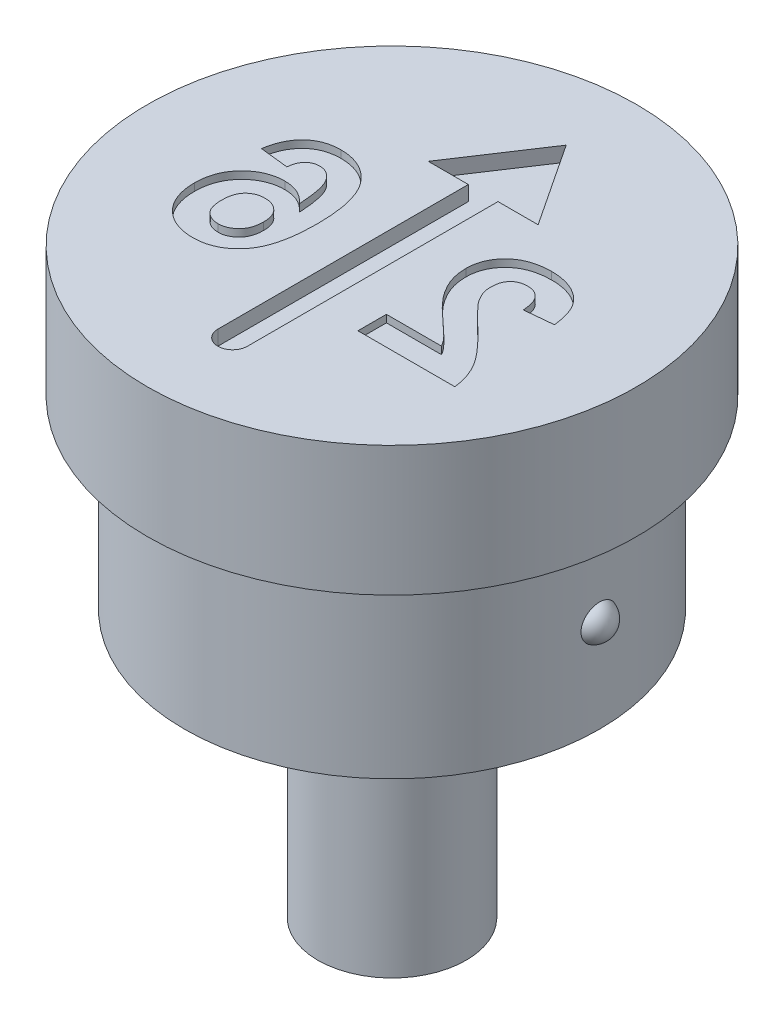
ISO-10303-21;
HEADER;
FILE_DESCRIPTION(('STEP AP214'),'2;1');
FILE_NAME('part.step','',(''),(''),'','','');
FILE_SCHEMA(('AUTOMOTIVE_DESIGN { 1 0 10303 214 1 1 1 1 }'));
ENDSEC;
DATA;
#1=APPLICATION_CONTEXT('core data for automotive mechanical design processes');
#2=APPLICATION_PROTOCOL_DEFINITION('international standard','automotive_design',2000,#1);
#3=PRODUCT_CONTEXT('',#1,'mechanical');
#4=PRODUCT('Part','Part','',(#3));
#5=PRODUCT_RELATED_PRODUCT_CATEGORY('part','',(#4));
#6=PRODUCT_DEFINITION_FORMATION('','',#4);
#7=PRODUCT_DEFINITION_CONTEXT('part definition',#1,'design');
#8=PRODUCT_DEFINITION('design','',#6,#7);
#9=PRODUCT_DEFINITION_SHAPE('','',#8);
#10=(LENGTH_UNIT() NAMED_UNIT(*) SI_UNIT(.MILLI.,.METRE.));
#11=(NAMED_UNIT(*) PLANE_ANGLE_UNIT() SI_UNIT($,.RADIAN.));
#12=(NAMED_UNIT(*) SI_UNIT($,.STERADIAN.) SOLID_ANGLE_UNIT());
#13=UNCERTAINTY_MEASURE_WITH_UNIT(LENGTH_MEASURE(1.E-05),#10,'distance_accuracy_value','');
#14=(GEOMETRIC_REPRESENTATION_CONTEXT(3) GLOBAL_UNCERTAINTY_ASSIGNED_CONTEXT((#13)) GLOBAL_UNIT_ASSIGNED_CONTEXT((#10,
#11,#12)) REPRESENTATION_CONTEXT('',''));
#15=CARTESIAN_POINT('',(0.,0.,0.));
#16=DIRECTION('',(0.,0.,1.));
#17=DIRECTION('',(1.,0.,0.));
#18=AXIS2_PLACEMENT_3D('',#15,#16,#17);
#19=CARTESIAN_POINT('',(0.,0.,0.));
#20=DIRECTION('',(0.,1.,0.));
#21=DIRECTION('',(0.,0.,1.));
#22=AXIS2_PLACEMENT_3D('',#19,#20,#21);
#23=CYLINDRICAL_SURFACE('',#22,5.6);
#24=CARTESIAN_POINT('',(0.,-3.5,0.));
#25=DIRECTION('',(0.,1.,0.));
#26=DIRECTION('',(0.,0.,1.));
#27=AXIS2_PLACEMENT_3D('',#24,#25,#26);
#28=CIRCLE('',#27,5.6);
#29=CARTESIAN_POINT('',(0.,-3.5,5.6));
#30=VERTEX_POINT('',#29);
#31=EDGE_CURVE('E464',#30,#30,#28,.T.);
#32=ORIENTED_EDGE('',*,*,#31,.F.);
#33=EDGE_LOOP('',(#32));
#34=FACE_BOUND('',#33,.T.);
#35=CARTESIAN_POINT('',(0.,-8.5,0.));
#36=DIRECTION('',(0.,1.,0.));
#37=DIRECTION('',(0.,0.,1.));
#38=AXIS2_PLACEMENT_3D('',#35,#36,#37);
#39=CIRCLE('',#38,5.6);
#40=CARTESIAN_POINT('',(0.,-8.5,5.6));
#41=VERTEX_POINT('',#40);
#42=EDGE_CURVE('E467',#41,#41,#39,.T.);
#43=ORIENTED_EDGE('',*,*,#42,.T.);
#44=EDGE_LOOP('',(#43));
#45=FACE_BOUND('',#44,.T.);
#46=CARTESIAN_POINT('',(5.57944494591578,-6.,-0.479368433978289));
#47=CARTESIAN_POINT('',(5.57944521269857,-6.02626962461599,-0.479367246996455));
#48=CARTESIAN_POINT('',(5.57963737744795,-6.05255726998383,-0.477144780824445));
#49=CARTESIAN_POINT('',(5.58038523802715,-6.10440075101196,-0.468315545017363));
#50=CARTESIAN_POINT('',(5.58094134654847,-6.12995572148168,-0.461703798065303));
#51=CARTESIAN_POINT('',(5.58235361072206,-6.17957069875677,-0.444301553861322));
#52=CARTESIAN_POINT('',(5.58320953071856,-6.20363186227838,-0.433514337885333));
#53=CARTESIAN_POINT('',(5.58512551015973,-6.24960575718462,-0.408086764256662));
#54=CARTESIAN_POINT('',(5.58618552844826,-6.27151892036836,-0.393447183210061));
#55=CARTESIAN_POINT('',(5.58839989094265,-6.31274560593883,-0.360635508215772));
#56=CARTESIAN_POINT('',(5.58955480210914,-6.33204135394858,-0.342441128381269));
#57=CARTESIAN_POINT('',(5.59182569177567,-6.36735293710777,-0.303105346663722));
#58=CARTESIAN_POINT('',(5.59294166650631,-6.38336845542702,-0.281963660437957));
#59=CARTESIAN_POINT('',(5.59502737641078,-6.41189756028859,-0.237024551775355));
#60=CARTESIAN_POINT('',(5.59599492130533,-6.42436066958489,-0.213194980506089));
#61=CARTESIAN_POINT('',(5.59765866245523,-6.44516916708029,-0.163792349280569));
#62=CARTESIAN_POINT('',(5.59835484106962,-6.45351428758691,-0.138219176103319));
#63=CARTESIAN_POINT('',(5.59940568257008,-6.46594466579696,-0.0857436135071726));
#64=CARTESIAN_POINT('',(5.59975638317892,-6.46998054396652,-0.0588294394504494));
#65=CARTESIAN_POINT('',(5.60006342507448,-6.47351960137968,-0.00470214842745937));
#66=CARTESIAN_POINT('',(5.60001975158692,-6.47302261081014,0.0225109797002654));
#67=CARTESIAN_POINT('',(5.59954158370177,-6.46749370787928,0.0766147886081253));
#68=CARTESIAN_POINT('',(5.59910503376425,-6.46243794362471,0.103503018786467));
#69=CARTESIAN_POINT('',(5.59788721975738,-6.4478891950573,0.156043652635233));
#70=CARTESIAN_POINT('',(5.5971059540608,-6.43839618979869,0.181696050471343));
#71=CARTESIAN_POINT('',(5.59528882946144,-6.41524557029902,0.230976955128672));
#72=CARTESIAN_POINT('',(5.5942534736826,-6.40159617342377,0.254609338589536));
#73=CARTESIAN_POINT('',(5.59204524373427,-6.37049174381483,0.299214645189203));
#74=CARTESIAN_POINT('',(5.59087237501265,-6.35303686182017,0.320187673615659));
#75=CARTESIAN_POINT('',(5.58853494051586,-6.3149731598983,0.358673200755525));
#76=CARTESIAN_POINT('',(5.58737039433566,-6.29439395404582,0.376214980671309));
#77=CARTESIAN_POINT('',(5.58517315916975,-6.25054281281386,0.407539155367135));
#78=CARTESIAN_POINT('',(5.58414046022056,-6.22727108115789,0.421321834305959));
#79=CARTESIAN_POINT('',(5.58233960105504,-6.17902949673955,0.444543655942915));
#80=CARTESIAN_POINT('',(5.58156807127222,-6.15408667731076,0.454038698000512));
#81=CARTESIAN_POINT('',(5.58035940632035,-6.10294450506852,0.468661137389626));
#82=CARTESIAN_POINT('',(5.57992224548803,-6.07674524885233,0.473788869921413));
#83=CARTESIAN_POINT('',(5.57943588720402,-6.02417035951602,0.479482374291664));
#84=CARTESIAN_POINT('',(5.57938210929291,-5.99780058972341,0.480102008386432));
#85=CARTESIAN_POINT('',(5.57965646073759,-5.94533439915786,0.476902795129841));
#86=CARTESIAN_POINT('',(5.57998457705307,-5.91923796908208,0.473084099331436));
#87=CARTESIAN_POINT('',(5.58098353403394,-5.8681600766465,0.461148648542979));
#88=CARTESIAN_POINT('',(5.5816530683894,-5.84317475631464,0.453048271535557));
#89=CARTESIAN_POINT('',(5.58325923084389,-5.79491022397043,0.43280349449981));
#90=CARTESIAN_POINT('',(5.58419586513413,-5.77163105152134,0.420659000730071));
#91=CARTESIAN_POINT('',(5.58623936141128,-5.72726845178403,0.392591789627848));
#92=CARTESIAN_POINT('',(5.58734730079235,-5.70620044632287,0.376644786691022));
#93=CARTESIAN_POINT('',(5.58960650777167,-5.6670016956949,0.341480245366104));
#94=CARTESIAN_POINT('',(5.59075777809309,-5.64887113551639,0.322262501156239));
#95=CARTESIAN_POINT('',(5.59299267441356,-5.61580776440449,0.280834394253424));
#96=CARTESIAN_POINT('',(5.59407523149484,-5.60091939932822,0.258588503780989));
#97=CARTESIAN_POINT('',(5.59603696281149,-5.5750297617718,0.211931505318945));
#98=CARTESIAN_POINT('',(5.59691612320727,-5.56402875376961,0.18752025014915));
#99=CARTESIAN_POINT('',(5.59838450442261,-5.54608134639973,0.136892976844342));
#100=CARTESIAN_POINT('',(5.59896991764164,-5.53918798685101,0.110658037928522));
#101=CARTESIAN_POINT('',(5.59976911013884,-5.5298520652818,0.0574020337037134));
#102=CARTESIAN_POINT('',(5.59998287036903,-5.52740973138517,0.0303809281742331));
#103=CARTESIAN_POINT('',(5.60001525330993,-5.52703712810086,-0.0238949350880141));
#104=CARTESIAN_POINT('',(5.59983091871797,-5.52914062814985,-0.0511499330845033));
#105=CARTESIAN_POINT('',(5.59908162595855,-5.53787476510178,-0.104919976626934));
#106=CARTESIAN_POINT('',(5.5985166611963,-5.54450548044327,-0.131435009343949));
#107=CARTESIAN_POINT('',(5.59706923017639,-5.56212546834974,-0.18297960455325));
#108=CARTESIAN_POINT('',(5.59618662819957,-5.57311660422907,-0.208008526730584));
#109=CARTESIAN_POINT('',(5.59420400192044,-5.59916633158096,-0.255842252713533));
#110=CARTESIAN_POINT('',(5.5931039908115,-5.61422467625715,-0.278647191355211));
#111=CARTESIAN_POINT('',(5.59082057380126,-5.64788381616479,-0.321212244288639));
#112=CARTESIAN_POINT('',(5.58963779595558,-5.66645944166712,-0.340992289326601));
#113=CARTESIAN_POINT('',(5.58731764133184,-5.70671444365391,-0.377107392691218));
#114=CARTESIAN_POINT('',(5.58618027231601,-5.72839434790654,-0.393441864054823));
#115=CARTESIAN_POINT('',(5.58409628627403,-5.77396033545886,-0.421985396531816));
#116=CARTESIAN_POINT('',(5.58314754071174,-5.79781676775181,-0.434241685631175));
#117=CARTESIAN_POINT('',(5.5815344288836,-5.8472564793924,-0.454508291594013));
#118=CARTESIAN_POINT('',(5.58086971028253,-5.87283757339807,-0.462523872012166));
#119=CARTESIAN_POINT('',(5.58007634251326,-5.91548411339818,-0.471975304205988));
#120=CARTESIAN_POINT('',(5.57984065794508,-5.93226396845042,-0.474743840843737));
#121=CARTESIAN_POINT('',(5.57952487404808,-5.96602670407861,-0.478440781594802));
#122=CARTESIAN_POINT('',(5.57944477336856,-5.98300958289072,-0.479369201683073));
#123=CARTESIAN_POINT('',(5.57944494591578,-6.,-0.479368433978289));
#124=B_SPLINE_CURVE_WITH_KNOTS('',3,(#46,#47,#48,#49,#50,#51,#52,#53,#54,#55,#56,#57,#58,#59,
#60,#61,#62,#63,#64,#65,#66,#67,#68,#69,#70,#71,#72,#73,#74,#75,#76,#77,#78,#79,#80,#81,#82,#83,
#84,#85,#86,#87,#88,#89,#90,#91,#92,#93,#94,#95,#96,#97,#98,#99,#100,#101,#102,#103,#104,#105,
#106,#107,#108,#109,#110,#111,#112,#113,#114,#115,#116,#117,#118,#119,#120,#121,#122,#123),
.UNSPECIFIED.,.T.,.F.,(4,2,2,2,2,2,2,2,2,2,2,2,2,2,2,2,2,2,2,2,2,2,2,2,2,2,2,2,2,2,2,2,2,2,2,2,
2,2,4),(0.,0.0787464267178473,0.15758230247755,0.236356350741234,0.315114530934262,
0.394383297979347,0.473659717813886,0.554012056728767,0.634369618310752,0.715638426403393,
0.796910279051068,0.878609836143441,0.960309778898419,1.0418492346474,1.12338546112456,
1.20419221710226,1.28499286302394,1.36470730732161,1.44441563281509,1.52317002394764,
1.60192172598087,1.6803743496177,1.75882879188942,1.8377983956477,1.91677297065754,
1.99677014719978,2.07677276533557,2.15778720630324,2.23880579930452,2.32042831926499,
2.40205225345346,2.4837111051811,2.56536500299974,2.64645527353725,2.72755934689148,
2.80768853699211,2.88771803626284,2.93864934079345,2.98958020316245),.UNSPECIFIED.);
#125=CARTESIAN_POINT('',(5.57944494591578,-6.,-0.479368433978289));
#126=VERTEX_POINT('',#125);
#127=EDGE_CURVE('E41',#126,#126,#124,.T.);
#128=ORIENTED_EDGE('',*,*,#127,.T.);
#129=EDGE_LOOP('',(#128));
#130=FACE_BOUND('',#129,.T.);
#131=ADVANCED_FACE('F37',(#34,#45,#130),#23,.T.);
#132=CARTESIAN_POINT('',(0.,0.,0.));
#133=DIRECTION('',(0.,1.,0.));
#134=DIRECTION('',(0.,0.,1.));
#135=AXIS2_PLACEMENT_3D('',#132,#133,#134);
#136=PLANE('',#135);
#137=DIRECTION('',(-1.,0.,0.));
#138=VECTOR('',#137,1.);
#139=CARTESIAN_POINT('',(3.01490250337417,0.,1.67917753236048));
#140=LINE('',#139,#138);
#141=CARTESIAN_POINT('',(3.01490250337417,0.,1.67917753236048));
#142=VERTEX_POINT('',#141);
#143=CARTESIAN_POINT('',(1.52852429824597,0.,1.67917753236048));
#144=VERTEX_POINT('',#143);
#145=EDGE_CURVE('E58',#142,#144,#140,.T.);
#146=ORIENTED_EDGE('',*,*,#145,.F.);
#147=CARTESIAN_POINT('',(1.91634481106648,0.,0.539754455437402));
#148=CARTESIAN_POINT('',(1.92851118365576,0.,0.555078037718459));
#149=CARTESIAN_POINT('',(1.95456873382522,0.,0.587897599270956));
#150=CARTESIAN_POINT('',(1.99889947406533,0.,0.638221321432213));
#151=CARTESIAN_POINT('',(2.05027498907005,0.,0.693190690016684));
#152=CARTESIAN_POINT('',(2.10796962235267,0.,0.753834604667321));
#153=CARTESIAN_POINT('',(2.17388914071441,0.,0.818005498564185));
#154=CARTESIAN_POINT('',(2.24566175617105,0.,0.888386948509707));
#155=CARTESIAN_POINT('',(2.32644567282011,0.,0.961378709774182));
#156=CARTESIAN_POINT('',(2.41011823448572,0.,1.03880157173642));
#157=CARTESIAN_POINT('',(2.49415449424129,0.,1.11415615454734));
#158=CARTESIAN_POINT('',(2.57139593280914,0.,1.18572630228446));
#159=CARTESIAN_POINT('',(2.64155686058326,0.,1.24905051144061));
#160=CARTESIAN_POINT('',(2.70136975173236,0.,1.30762456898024));
#161=CARTESIAN_POINT('',(2.75435278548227,0.,1.35745083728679));
#162=CARTESIAN_POINT('',(2.79859627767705,0.,1.40108434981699));
#163=CARTESIAN_POINT('',(2.83492812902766,0.,1.43746877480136));
#164=CARTESIAN_POINT('',(2.88499108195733,0.,1.49418286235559));
#165=CARTESIAN_POINT('',(2.94869050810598,0.,1.57088868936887));
#166=CARTESIAN_POINT('',(2.99350565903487,0.,1.64418327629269));
#167=CARTESIAN_POINT('',(3.01490250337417,0.,1.67917753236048));
#168=B_SPLINE_CURVE_WITH_KNOTS('',3,(#147,#148,#149,#150,#151,#152,#153,#154,#155,#156,#157,
#158,#159,#160,#161,#162,#163,#164,#165,#166,#167),.UNSPECIFIED.,.F.,.F.,(4,1,1,1,1,1,1,1,1,1,1,
1,1,1,1,1,1,1,4),(0.,0.0369753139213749,0.0791925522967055,0.126700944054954,0.179184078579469,
0.23736864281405,0.300558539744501,0.369153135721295,0.443112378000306,0.516018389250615,
0.582473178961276,0.642136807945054,0.694619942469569,0.740679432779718,0.779589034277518,
0.812073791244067,0.837814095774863,0.922564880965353,1.),.UNSPECIFIED.);
#169=CARTESIAN_POINT('',(1.91634481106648,0.,0.539754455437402));
#170=VERTEX_POINT('',#169);
#171=EDGE_CURVE('E279',#170,#142,#168,.T.);
#172=ORIENTED_EDGE('',*,*,#171,.F.);
#173=CARTESIAN_POINT('',(1.52852429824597,0.,-0.463450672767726));
#174=CARTESIAN_POINT('',(1.52950294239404,0.,-0.419848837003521));
#175=CARTESIAN_POINT('',(1.53144442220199,0.,-0.33334948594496));
#176=CARTESIAN_POINT('',(1.55003265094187,0.,-0.205477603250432));
#177=CARTESIAN_POINT('',(1.57843184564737,0.,-0.0805544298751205));
#178=CARTESIAN_POINT('',(1.6204036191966,0.,0.0417253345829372));
#179=CARTESIAN_POINT('',(1.67360610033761,0.,0.164294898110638));
#180=CARTESIAN_POINT('',(1.74218537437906,0.,0.287429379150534));
#181=CARTESIAN_POINT('',(1.82181109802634,0.,0.414842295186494));
#182=CARTESIAN_POINT('',(1.88415490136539,0.,0.497220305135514));
#183=CARTESIAN_POINT('',(1.91634481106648,0.,0.539754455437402));
#184=B_SPLINE_CURVE_WITH_KNOTS('',3,(#173,#174,#175,#176,#177,#178,#179,#180,#181,#182,#183),
.UNSPECIFIED.,.F.,.F.,(4,1,1,1,1,1,1,1,4),(0.,0.119176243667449,0.236427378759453,
0.352663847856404,0.469086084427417,0.589462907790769,0.717601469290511,0.854189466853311,1.),.UNSPECIFIED.);
#185=CARTESIAN_POINT('',(1.52852429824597,0.,-0.463450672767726));
#186=VERTEX_POINT('',#185);
#187=EDGE_CURVE('E282',#186,#170,#184,.T.);
#188=ORIENTED_EDGE('',*,*,#187,.F.);
#189=CARTESIAN_POINT('',(2.75608840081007,0.,-1.55159169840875));
#190=CARTESIAN_POINT('',(2.70957963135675,0.,-1.55069782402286));
#191=CARTESIAN_POINT('',(2.61899796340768,0.,-1.54895689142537));
#192=CARTESIAN_POINT('',(2.48676480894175,0.,-1.5345802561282));
#193=CARTESIAN_POINT('',(2.36254126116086,0.,-1.50951250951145));
#194=CARTESIAN_POINT('',(2.24524127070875,0.,-1.47630673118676));
#195=CARTESIAN_POINT('',(2.13606944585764,0.,-1.43197458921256));
#196=CARTESIAN_POINT('',(2.03411606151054,0.,-1.37837887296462));
#197=CARTESIAN_POINT('',(1.94098568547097,0.,-1.31348551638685));
#198=CARTESIAN_POINT('',(1.85529008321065,0.,-1.24083343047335));
#199=CARTESIAN_POINT('',(1.77868507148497,0.,-1.16093969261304));
#200=CARTESIAN_POINT('',(1.71158601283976,0.,-1.07571951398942));
#201=CARTESIAN_POINT('',(1.65537064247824,0.,-0.985232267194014));
#202=CARTESIAN_POINT('',(1.60819731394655,0.,-0.890580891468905));
#203=CARTESIAN_POINT('',(1.57317143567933,0.,-0.790242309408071));
#204=CARTESIAN_POINT('',(1.54765005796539,0.,-0.685603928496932));
#205=CARTESIAN_POINT('',(1.53072835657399,0.,-0.576177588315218));
#206=CARTESIAN_POINT('',(1.52926710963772,0.,-0.501441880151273));
#207=CARTESIAN_POINT('',(1.52852429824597,0.,-0.463450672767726));
#208=B_SPLINE_CURVE_WITH_KNOTS('',3,(#189,#190,#191,#192,#193,#194,#195,#196,#197,#198,#199,
#200,#201,#202,#203,#204,#205,#206,#207),.UNSPECIFIED.,.F.,.F.,(4,1,1,1,1,1,1,1,1,1,1,1,1,1,1,1,
4),(0.,0.0756723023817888,0.147381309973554,0.216084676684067,0.28169803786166,
0.345459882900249,0.407485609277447,0.46873129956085,0.529782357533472,0.590032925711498,
0.648548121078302,0.70595351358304,0.763101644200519,0.820289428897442,0.878479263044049,
0.938226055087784,1.),.UNSPECIFIED.);
#209=CARTESIAN_POINT('',(2.75608840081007,0.,-1.55159169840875));
#210=VERTEX_POINT('',#209);
#211=EDGE_CURVE('E1223',#210,#186,#208,.T.);
#212=ORIENTED_EDGE('',*,*,#211,.F.);
#213=CARTESIAN_POINT('',(4.04134481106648,0.,-0.344860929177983));
#214=CARTESIAN_POINT('',(4.0351603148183,0.,-0.396793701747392));
#215=CARTESIAN_POINT('',(4.02316956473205,0.,-0.497483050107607));
#216=CARTESIAN_POINT('',(3.99324644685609,0.,-0.642107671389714));
#217=CARTESIAN_POINT('',(3.95534992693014,0.,-0.775530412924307));
#218=CARTESIAN_POINT('',(3.90767335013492,0.,-0.897503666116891));
#219=CARTESIAN_POINT('',(3.85218724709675,0.,-1.00880306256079));
#220=CARTESIAN_POINT('',(3.78606136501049,0.,-1.10775848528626));
#221=CARTESIAN_POINT('',(3.7116062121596,0.,-1.19546608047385));
#222=CARTESIAN_POINT('',(3.62875744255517,0.,-1.27187916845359));
#223=CARTESIAN_POINT('',(3.53804175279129,0.,-1.33724083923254));
#224=CARTESIAN_POINT('',(3.44285191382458,0.,-1.39558616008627));
#225=CARTESIAN_POINT('',(3.34132765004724,0.,-1.44344787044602));
#226=CARTESIAN_POINT('',(3.23458674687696,0.,-1.4828931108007));
#227=CARTESIAN_POINT('',(3.12267744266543,0.,-1.51441743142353));
#228=CARTESIAN_POINT('',(3.00508214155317,0.,-1.53526088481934));
#229=CARTESIAN_POINT('',(2.88252659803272,0.,-1.54992225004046));
#230=CARTESIAN_POINT('',(2.79886967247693,0.,-1.55102682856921));
#231=CARTESIAN_POINT('',(2.75608840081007,0.,-1.55159169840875));
#232=B_SPLINE_CURVE_WITH_KNOTS('',3,(#213,#214,#215,#216,#217,#218,#219,#220,#221,#222,#223,
#224,#225,#226,#227,#228,#229,#230,#231),.UNSPECIFIED.,.F.,.F.,(4,1,1,1,1,1,1,1,1,1,1,1,1,1,1,1,
4),(0.,0.0794357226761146,0.154013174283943,0.224141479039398,0.289934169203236,
0.352732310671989,0.41272577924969,0.470302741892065,0.527168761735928,0.583502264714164,
0.639948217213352,0.696584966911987,0.753726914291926,0.812707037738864,0.872963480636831,
0.93503486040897,1.),.UNSPECIFIED.);
#233=CARTESIAN_POINT('',(4.04134481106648,0.,-0.344860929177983));
#234=VERTEX_POINT('',#233);
#235=EDGE_CURVE('E1218',#234,#210,#232,.T.);
#236=ORIENTED_EDGE('',*,*,#235,.F.);
#237=DIRECTION('',(0.995240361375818,0.,-0.0974506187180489));
#238=VECTOR('',#237,1.);
#239=CARTESIAN_POINT('',(3.27211404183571,0.,-0.26954041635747));
#240=LINE('',#239,#238);
#241=CARTESIAN_POINT('',(3.27211404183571,0.,-0.26954041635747));
#242=VERTEX_POINT('',#241);
#243=EDGE_CURVE('E1212',#242,#234,#240,.T.);
#244=ORIENTED_EDGE('',*,*,#243,.F.);
#245=CARTESIAN_POINT('',(2.77211404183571,0.,-0.884925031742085));
#246=CARTESIAN_POINT('',(2.80700299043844,0.,-0.883344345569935));
#247=CARTESIAN_POINT('',(2.87440090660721,0.,-0.880290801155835));
#248=CARTESIAN_POINT('',(2.97018796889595,0.,-0.853615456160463));
#249=CARTESIAN_POINT('',(3.05398396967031,0.,-0.807437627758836));
#250=CARTESIAN_POINT('',(3.1137014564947,0.,-0.754813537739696));
#251=CARTESIAN_POINT('',(3.15404345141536,0.,-0.70364043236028));
#252=CARTESIAN_POINT('',(3.18153107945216,0.,-0.659046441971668));
#253=CARTESIAN_POINT('',(3.20522326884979,0.,-0.608373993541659));
#254=CARTESIAN_POINT('',(3.22621652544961,0.,-0.552193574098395));
#255=CARTESIAN_POINT('',(3.24279882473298,0.,-0.489861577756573));
#256=CARTESIAN_POINT('',(3.25615317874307,0.,-0.421852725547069));
#257=CARTESIAN_POINT('',(3.26691485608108,0.,-0.347801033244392));
#258=CARTESIAN_POINT('',(3.27033725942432,0.,-0.296285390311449));
#259=CARTESIAN_POINT('',(3.27211404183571,0.,-0.26954041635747));
#260=B_SPLINE_CURVE_WITH_KNOTS('',3,(#245,#246,#247,#248,#249,#250,#251,#252,#253,#254,#255,
#256,#257,#258,#259),.UNSPECIFIED.,.F.,.F.,(4,1,1,1,1,1,1,1,1,1,1,1,4),(0.,0.116899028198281,
0.225823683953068,0.330086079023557,0.435451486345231,0.490306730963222,0.548244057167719,
0.610766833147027,0.677675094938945,0.749188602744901,0.826858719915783,0.910111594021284,1.),.UNSPECIFIED.);
#261=CARTESIAN_POINT('',(2.77211404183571,0.,-0.884925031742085));
#262=VERTEX_POINT('',#261);
#263=EDGE_CURVE('E1204',#262,#242,#260,.T.);
#264=ORIENTED_EDGE('',*,*,#263,.F.);
#265=CARTESIAN_POINT('',(2.29775506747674,0.,-0.360085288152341));
#266=CARTESIAN_POINT('',(2.2991957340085,0.,-0.399994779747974));
#267=CARTESIAN_POINT('',(2.30192136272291,0.,-0.475500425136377));
#268=CARTESIAN_POINT('',(2.32477623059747,0.,-0.582052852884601));
#269=CARTESIAN_POINT('',(2.36530562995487,0.,-0.673649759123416));
#270=CARTESIAN_POINT('',(2.42110715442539,0.,-0.750572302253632));
#271=CARTESIAN_POINT('',(2.49166829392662,0.,-0.810840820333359));
#272=CARTESIAN_POINT('',(2.57415631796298,0.,-0.855373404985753));
#273=CARTESIAN_POINT('',(2.66977871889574,0.,-0.879994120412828));
#274=CARTESIAN_POINT('',(2.7369877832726,0.,-0.883232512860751));
#275=CARTESIAN_POINT('',(2.77211404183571,0.,-0.884925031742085));
#276=B_SPLINE_CURVE_WITH_KNOTS('',3,(#265,#266,#267,#268,#269,#270,#271,#272,#273,#274,#275),
.UNSPECIFIED.,.F.,.F.,(4,1,1,1,1,1,1,1,4),(0.,0.149140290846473,0.282161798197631,
0.404655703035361,0.521109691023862,0.634416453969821,0.748796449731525,0.868710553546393,1.),.UNSPECIFIED.);
#277=CARTESIAN_POINT('',(2.29775506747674,0.,-0.360085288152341));
#278=VERTEX_POINT('',#277);
#279=EDGE_CURVE('E1196',#278,#262,#276,.T.);
#280=ORIENTED_EDGE('',*,*,#279,.F.);
#281=CARTESIAN_POINT('',(2.44999865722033,0.,0.102254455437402));
#282=CARTESIAN_POINT('',(2.42683885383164,0.,0.0637835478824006));
#283=CARTESIAN_POINT('',(2.38216627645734,0.,-0.0104223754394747));
#284=CARTESIAN_POINT('',(2.33317908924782,0.,-0.127112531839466));
#285=CARTESIAN_POINT('',(2.30377515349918,0.,-0.243778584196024));
#286=CARTESIAN_POINT('',(2.29974013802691,0.,-0.321734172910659));
#287=CARTESIAN_POINT('',(2.29775506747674,0.,-0.360085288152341));
#288=B_SPLINE_CURVE_WITH_KNOTS('',3,(#281,#282,#283,#284,#285,#286,#287),.UNSPECIFIED.,.F.,.F.,
(4,1,1,1,4),(0.,0.272795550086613,0.526191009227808,0.766904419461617,1.),.UNSPECIFIED.);
#289=CARTESIAN_POINT('',(2.44999865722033,0.,0.102254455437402));
#290=VERTEX_POINT('',#289);
#291=EDGE_CURVE('E1188',#290,#278,#288,.T.);
#292=ORIENTED_EDGE('',*,*,#291,.F.);
#293=CARTESIAN_POINT('',(3.06217814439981,0.,0.748087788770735));
#294=CARTESIAN_POINT('',(3.02263002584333,0.,0.709913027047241));
#295=CARTESIAN_POINT('',(2.947342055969,0.,0.637239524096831));
#296=CARTESIAN_POINT('',(2.84013184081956,0.,0.533174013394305));
#297=CARTESIAN_POINT('',(2.74588301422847,0.,0.437508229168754));
#298=CARTESIAN_POINT('',(2.66262496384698,0.,0.352721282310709));
#299=CARTESIAN_POINT('',(2.59228106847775,0.,0.276654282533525));
#300=CARTESIAN_POINT('',(2.53392601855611,0.,0.210501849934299));
#301=CARTESIAN_POINT('',(2.48682075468,0.,0.153994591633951));
#302=CARTESIAN_POINT('',(2.46130850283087,0.,0.118146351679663));
#303=CARTESIAN_POINT('',(2.44999865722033,0.,0.102254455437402));
#304=B_SPLINE_CURVE_WITH_KNOTS('',3,(#293,#294,#295,#296,#297,#298,#299,#300,#301,#302,#303),
.UNSPECIFIED.,.F.,.F.,(4,1,1,1,1,1,1,1,4),(0.,0.18509006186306,0.352356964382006,
0.503079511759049,0.637279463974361,0.752473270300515,0.851885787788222,0.934339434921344,1.),.UNSPECIFIED.);
#305=CARTESIAN_POINT('',(3.06217814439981,0.,0.748087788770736));
#306=VERTEX_POINT('',#305);
#307=EDGE_CURVE('E1180',#306,#290,#304,.T.);
#308=ORIENTED_EDGE('',*,*,#307,.F.);
#309=CARTESIAN_POINT('',(4.14390891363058,0.,2.44840830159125));
#310=CARTESIAN_POINT('',(4.1350538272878,0.,2.38266637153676));
#311=CARTESIAN_POINT('',(4.11734861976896,0.,2.25121937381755));
#312=CARTESIAN_POINT('',(4.06261044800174,0.,2.05920839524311));
#313=CARTESIAN_POINT('',(3.98955373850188,0.,1.87183848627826));
#314=CARTESIAN_POINT('',(3.91026455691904,0.,1.71936486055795));
#315=CARTESIAN_POINT('',(3.8314026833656,0.,1.59662883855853));
#316=CARTESIAN_POINT('',(3.75985130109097,0.,1.49605799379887));
#317=CARTESIAN_POINT('',(3.67449312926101,0.,1.38905493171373));
#318=CARTESIAN_POINT('',(3.57656680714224,0.,1.27475584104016));
#319=CARTESIAN_POINT('',(3.46661351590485,0.,1.15280342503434));
#320=CARTESIAN_POINT('',(3.34381293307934,0.,1.02365107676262));
#321=CARTESIAN_POINT('',(3.20757928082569,0.,0.887917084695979));
#322=CARTESIAN_POINT('',(3.11173647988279,0.,0.795747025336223));
#323=CARTESIAN_POINT('',(3.06217814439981,0.,0.748087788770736));
#324=B_SPLINE_CURVE_WITH_KNOTS('',3,(#309,#310,#311,#312,#313,#314,#315,#316,#317,#318,#319,
#320,#321,#322,#323),.UNSPECIFIED.,.F.,.F.,(4,1,1,1,1,1,1,1,1,1,1,1,4),(0.,0.0963574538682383,
0.192660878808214,0.289454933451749,0.388479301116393,0.441921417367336,0.501521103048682,
0.567882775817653,0.640891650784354,0.72037065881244,0.806636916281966,0.900015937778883,1.),.UNSPECIFIED.);
#325=CARTESIAN_POINT('',(4.14390891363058,0.,2.44840830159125));
#326=VERTEX_POINT('',#325);
#327=EDGE_CURVE('E1175',#326,#306,#324,.T.);
#328=ORIENTED_EDGE('',*,*,#327,.F.);
#329=DIRECTION('',(1.,0.,0.));
#330=VECTOR('',#329,1.);
#331=CARTESIAN_POINT('',(1.52852429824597,0.,2.44840830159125));
#332=LINE('',#331,#330);
#333=CARTESIAN_POINT('',(1.52852429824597,0.,2.44840830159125));
#334=VERTEX_POINT('',#333);
#335=EDGE_CURVE('E1172',#334,#326,#332,.T.);
#336=ORIENTED_EDGE('',*,*,#335,.F.);
#337=DIRECTION('',(0.,0.,1.));
#338=VECTOR('',#337,1.);
#339=CARTESIAN_POINT('',(1.52852429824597,0.,1.67917753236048));
#340=LINE('',#339,#338);
#341=EDGE_CURVE('E1170',#144,#334,#340,.T.);
#342=ORIENTED_EDGE('',*,*,#341,.F.);
#343=EDGE_LOOP('',(#146,#172,#188,#212,#236,#244,#264,#280,#292,#308,#328,#336,#342));
#344=FACE_BOUND('',#343,.T.);
#345=CARTESIAN_POINT('',(-2.93269365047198,0.,-1.55159169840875));
#346=CARTESIAN_POINT('',(-2.96879471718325,0.,-1.55094222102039));
#347=CARTESIAN_POINT('',(-3.03936768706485,0.,-1.54967257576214));
#348=CARTESIAN_POINT('',(-3.14280253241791,0.,-1.53619000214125));
#349=CARTESIAN_POINT('',(-3.24147841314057,0.,-1.51557296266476));
#350=CARTESIAN_POINT('',(-3.33565395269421,0.,-1.48703419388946));
#351=CARTESIAN_POINT('',(-3.42466609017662,0.,-1.44881526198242));
#352=CARTESIAN_POINT('',(-3.50886829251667,0.,-1.40225575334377));
#353=CARTESIAN_POINT('',(-3.58854363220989,0.,-1.34748176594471));
#354=CARTESIAN_POINT('',(-3.66327755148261,0.,-1.28484595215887));
#355=CARTESIAN_POINT('',(-3.73246856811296,0.,-1.21415874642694));
#356=CARTESIAN_POINT('',(-3.7949464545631,0.,-1.13526021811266));
#357=CARTESIAN_POINT('',(-3.85112497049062,0.,-1.04910257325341));
#358=CARTESIAN_POINT('',(-3.90124998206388,0.,-0.955757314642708));
#359=CARTESIAN_POINT('',(-3.94329401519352,0.,-0.854330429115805));
#360=CARTESIAN_POINT('',(-3.97943779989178,0.,-0.745619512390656));
#361=CARTESIAN_POINT('',(-4.00916354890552,0.,-0.629391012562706));
#362=CARTESIAN_POINT('',(-4.02324636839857,0.,-0.548763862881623));
#363=CARTESIAN_POINT('',(-4.03045006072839,0.,-0.507521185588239));
#364=B_SPLINE_CURVE_WITH_KNOTS('',3,(#345,#346,#347,#348,#349,#350,#351,#352,#353,#354,#355,
#356,#357,#358,#359,#360,#361,#362,#363),.UNSPECIFIED.,.F.,.F.,(4,1,1,1,1,1,1,1,1,1,1,1,1,1,1,1,
4),(0.,0.0647517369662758,0.126581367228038,0.186839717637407,0.245514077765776,
0.302849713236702,0.360345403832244,0.417912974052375,0.476091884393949,0.535068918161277,
0.59510381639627,0.656390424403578,0.719434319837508,0.784953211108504,0.853160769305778,
0.924888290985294,1.),.UNSPECIFIED.);
#365=CARTESIAN_POINT('',(-2.93269365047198,0.,-1.55159169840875));
#366=VERTEX_POINT('',#365);
#367=CARTESIAN_POINT('',(-4.03045006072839,0.,-0.507521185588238));
#368=VERTEX_POINT('',#367);
#369=EDGE_CURVE('E66',#366,#368,#364,.T.);
#370=ORIENTED_EDGE('',*,*,#369,.F.);
#371=CARTESIAN_POINT('',(-1.51762954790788,0.,0.502094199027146));
#372=CARTESIAN_POINT('',(-1.51882549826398,0.,0.414451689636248));
#373=CARTESIAN_POINT('',(-1.521136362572,0.,0.2451052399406));
#374=CARTESIAN_POINT('',(-1.53973166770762,0.,0.000592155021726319));
#375=CARTESIAN_POINT('',(-1.56926867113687,0.,-0.225205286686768));
#376=CARTESIAN_POINT('',(-1.61229671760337,0.,-0.431777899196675));
#377=CARTESIAN_POINT('',(-1.66733291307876,0.,-0.619554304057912));
#378=CARTESIAN_POINT('',(-1.73405540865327,0.,-0.788911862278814));
#379=CARTESIAN_POINT('',(-1.81414048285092,0.,-0.939237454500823));
#380=CARTESIAN_POINT('',(-1.90725191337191,0.,-1.07004220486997));
#381=CARTESIAN_POINT('',(-2.00970132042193,0.,-1.18374596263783));
#382=CARTESIAN_POINT('',(-2.11978365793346,0.,-1.28189160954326));
#383=CARTESIAN_POINT('',(-2.23707867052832,0.,-1.36542818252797));
#384=CARTESIAN_POINT('',(-2.36158354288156,0.,-1.43414473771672));
#385=CARTESIAN_POINT('',(-2.49432035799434,0.,-1.48623837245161));
#386=CARTESIAN_POINT('',(-2.63403006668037,0.,-1.52385649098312));
#387=CARTESIAN_POINT('',(-2.78094733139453,0.,-1.54803305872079));
#388=CARTESIAN_POINT('',(-2.88158333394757,0.,-1.55039309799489));
#389=CARTESIAN_POINT('',(-2.93269365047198,0.,-1.55159169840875));
#390=B_SPLINE_CURVE_WITH_KNOTS('',3,(#371,#372,#373,#374,#375,#376,#377,#378,#379,#380,#381,
#382,#383,#384,#385,#386,#387,#388,#389),.UNSPECIFIED.,.F.,.F.,(4,1,1,1,1,1,1,1,1,1,1,1,1,1,1,1,
4),(0.,0.0932311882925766,0.180145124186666,0.260720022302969,0.335343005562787,
0.40439372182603,0.46866345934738,0.528671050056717,0.585123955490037,0.639046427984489,
0.691174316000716,0.741714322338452,0.79194664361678,0.842075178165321,0.893016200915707,
0.945665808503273,1.),.UNSPECIFIED.);
#391=CARTESIAN_POINT('',(-1.51762954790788,0.,0.502094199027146));
#392=VERTEX_POINT('',#391);
#393=EDGE_CURVE('E386',#392,#366,#390,.T.);
#394=ORIENTED_EDGE('',*,*,#393,.F.);
#395=CARTESIAN_POINT('',(-2.87500134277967,0.,2.4996903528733));
#396=CARTESIAN_POINT('',(-2.82657880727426,0.,2.49833562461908));
#397=CARTESIAN_POINT('',(-2.73137148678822,0.,2.4956719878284));
#398=CARTESIAN_POINT('',(-2.59199854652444,0.,2.47375160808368));
#399=CARTESIAN_POINT('',(-2.45949462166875,0.,2.43666579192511));
#400=CARTESIAN_POINT('',(-2.33387617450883,0.,2.38487386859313));
#401=CARTESIAN_POINT('',(-2.21409910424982,0.,2.3197276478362));
#402=CARTESIAN_POINT('',(-2.10127562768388,0.,2.23880416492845));
#403=CARTESIAN_POINT('',(-1.99570472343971,0.,2.14287512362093));
#404=CARTESIAN_POINT('',(-1.89599004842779,0.,2.03323962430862));
#405=CARTESIAN_POINT('',(-1.80525236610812,0.,1.90660196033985));
#406=CARTESIAN_POINT('',(-1.72797938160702,0.,1.76023545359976));
#407=CARTESIAN_POINT('',(-1.66244414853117,0.,1.59574310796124));
#408=CARTESIAN_POINT('',(-1.60908886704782,0.,1.41270306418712));
#409=CARTESIAN_POINT('',(-1.56790244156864,0.,1.21112984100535));
#410=CARTESIAN_POINT('',(-1.53916348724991,0.,0.991006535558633));
#411=CARTESIAN_POINT('',(-1.52007481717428,0.,0.75269717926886));
#412=CARTESIAN_POINT('',(-1.51846391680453,0.,0.587604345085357));
#413=CARTESIAN_POINT('',(-1.51762954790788,0.,0.502094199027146));
#414=B_SPLINE_CURVE_WITH_KNOTS('',3,(#395,#396,#397,#398,#399,#400,#401,#402,#403,#404,#405,
#406,#407,#408,#409,#410,#411,#412,#413),.UNSPECIFIED.,.F.,.F.,(4,1,1,1,1,1,1,1,1,1,1,1,1,1,1,1,
4),(0.,0.0532594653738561,0.104717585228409,0.154775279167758,0.20433007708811,0.25391362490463,
0.304476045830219,0.356706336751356,0.410596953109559,0.467274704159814,0.52762561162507,
0.59224090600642,0.661798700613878,0.737130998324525,0.818387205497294,0.905933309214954,1.),.UNSPECIFIED.);
#415=CARTESIAN_POINT('',(-2.87500134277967,0.,2.4996903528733));
#416=VERTEX_POINT('',#415);
#417=EDGE_CURVE('E558',#416,#392,#414,.T.);
#418=ORIENTED_EDGE('',*,*,#417,.F.);
#419=CARTESIAN_POINT('',(-4.1330141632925,0.,1.19520317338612));
#420=CARTESIAN_POINT('',(-4.13190384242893,0.,1.24332060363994));
#421=CARTESIAN_POINT('',(-4.12973845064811,0.,1.33716112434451));
#422=CARTESIAN_POINT('',(-4.1137996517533,0.,1.47459278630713));
#423=CARTESIAN_POINT('',(-4.08564496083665,0.,1.60431280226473));
#424=CARTESIAN_POINT('',(-4.04717957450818,0.,1.72736192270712));
#425=CARTESIAN_POINT('',(-3.99742571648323,0.,1.84276511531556));
#426=CARTESIAN_POINT('',(-3.93715295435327,0.,1.95147342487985));
#427=CARTESIAN_POINT('',(-3.86432160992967,0.,2.0516291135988));
#428=CARTESIAN_POINT('',(-3.78223693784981,0.,2.14457941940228));
#429=CARTESIAN_POINT('',(-3.69072877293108,0.,2.22752553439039));
#430=CARTESIAN_POINT('',(-3.59320705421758,0.,2.30097529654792));
#431=CARTESIAN_POINT('',(-3.48859012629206,0.,2.3620319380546));
#432=CARTESIAN_POINT('',(-3.37842435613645,0.,2.41342155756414));
#433=CARTESIAN_POINT('',(-3.26081756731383,0.,2.45113479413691));
#434=CARTESIAN_POINT('',(-3.13784314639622,0.,2.47941782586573));
#435=CARTESIAN_POINT('',(-3.00850115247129,0.,2.49666794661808));
#436=CARTESIAN_POINT('',(-2.9201935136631,0.,2.4986672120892));
#437=CARTESIAN_POINT('',(-2.87500134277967,0.,2.4996903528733));
#438=B_SPLINE_CURVE_WITH_KNOTS('',3,(#419,#420,#421,#422,#423,#424,#425,#426,#427,#428,#429,
#430,#431,#432,#433,#434,#435,#436,#437),.UNSPECIFIED.,.F.,.F.,(4,1,1,1,1,1,1,1,1,1,1,1,1,1,1,1,
4),(0.,0.0708046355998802,0.13808600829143,0.203231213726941,0.265884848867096,
0.327509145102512,0.387868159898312,0.448411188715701,0.509386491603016,0.570040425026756,
0.629864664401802,0.68871511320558,0.747985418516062,0.80839432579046,0.870086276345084,
0.933515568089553,1.),.UNSPECIFIED.);
#439=CARTESIAN_POINT('',(-4.1330141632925,0.,1.19520317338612));
#440=VERTEX_POINT('',#439);
#441=EDGE_CURVE('E566',#440,#416,#438,.T.);
#442=ORIENTED_EDGE('',*,*,#441,.F.);
#443=CARTESIAN_POINT('',(-2.95112313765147,0.,-0.0644122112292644));
#444=CARTESIAN_POINT('',(-2.99096602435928,0.,-0.0632647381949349));
#445=CARTESIAN_POINT('',(-3.06964157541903,0.,-0.0609988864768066));
#446=CARTESIAN_POINT('',(-3.18554892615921,0.,-0.0451066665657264));
#447=CARTESIAN_POINT('',(-3.29676964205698,0.,-0.0165295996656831));
#448=CARTESIAN_POINT('',(-3.40380686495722,0.,0.0221279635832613));
#449=CARTESIAN_POINT('',(-3.50718961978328,0.,0.0708074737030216));
#450=CARTESIAN_POINT('',(-3.60494030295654,0.,0.132428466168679));
#451=CARTESIAN_POINT('',(-3.69859334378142,0.,0.204275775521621));
#452=CARTESIAN_POINT('',(-3.78686073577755,0.,0.286360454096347));
#453=CARTESIAN_POINT('',(-3.86795724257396,0.,0.376728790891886));
#454=CARTESIAN_POINT('',(-3.93955743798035,0.,0.474333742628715));
#455=CARTESIAN_POINT('',(-3.99848204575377,0.,0.579473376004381));
#456=CARTESIAN_POINT('',(-4.04885552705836,0.,0.689793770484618));
#457=CARTESIAN_POINT('',(-4.08633531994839,0.,0.807472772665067));
#458=CARTESIAN_POINT('',(-4.11354168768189,0.,0.930816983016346));
#459=CARTESIAN_POINT('',(-4.12978197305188,0.,1.06095860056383));
#460=CARTESIAN_POINT('',(-4.1319198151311,0.,1.14975092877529));
#461=CARTESIAN_POINT('',(-4.1330141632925,0.,1.19520317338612));
#462=B_SPLINE_CURVE_WITH_KNOTS('',3,(#443,#444,#445,#446,#447,#448,#449,#450,#451,#452,#453,
#454,#455,#456,#457,#458,#459,#460,#461),.UNSPECIFIED.,.F.,.F.,(4,1,1,1,1,1,1,1,1,1,1,1,1,1,1,1,
4),(0.,0.0619593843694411,0.122347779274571,0.181484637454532,0.240217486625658,
0.299114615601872,0.358819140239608,0.419550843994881,0.482449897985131,0.545990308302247,
0.608137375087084,0.670271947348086,0.733113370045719,0.796428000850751,0.861936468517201,
0.9293261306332,1.),.UNSPECIFIED.);
#463=CARTESIAN_POINT('',(-2.95112313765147,0.,-0.0644122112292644));
#464=VERTEX_POINT('',#463);
#465=EDGE_CURVE('E574',#464,#440,#462,.T.);
#466=ORIENTED_EDGE('',*,*,#465,.F.);
#467=CARTESIAN_POINT('',(-2.22836672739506,0.,0.270523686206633));
#468=CARTESIAN_POINT('',(-2.25295144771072,0.,0.24382144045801));
#469=CARTESIAN_POINT('',(-2.30115949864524,0.,0.191461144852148));
#470=CARTESIAN_POINT('',(-2.38115186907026,0.,0.12319535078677));
#471=CARTESIAN_POINT('',(-2.46495577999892,0.,0.0648326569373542));
#472=CARTESIAN_POINT('',(-2.55348313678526,0.,0.0169512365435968));
#473=CARTESIAN_POINT('',(-2.64721715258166,0.,-0.018680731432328));
#474=CARTESIAN_POINT('',(-2.74445991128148,0.,-0.0457353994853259));
#475=CARTESIAN_POINT('',(-2.84648432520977,0.,-0.060890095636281));
#476=CARTESIAN_POINT('',(-2.91581968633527,0.,-0.0632239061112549));
#477=CARTESIAN_POINT('',(-2.95112313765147,0.,-0.0644122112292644));
#478=B_SPLINE_CURVE_WITH_KNOTS('',3,(#467,#468,#469,#470,#471,#472,#473,#474,#475,#476,#477),
.UNSPECIFIED.,.F.,.F.,(4,1,1,1,1,1,1,1,4),(0.,0.132218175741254,0.259265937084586,
0.382426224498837,0.503963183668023,0.625109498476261,0.747226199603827,0.871295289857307,1.),.UNSPECIFIED.);
#479=CARTESIAN_POINT('',(-2.22836672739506,0.,0.270523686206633));
#480=VERTEX_POINT('',#479);
#481=EDGE_CURVE('E582',#480,#464,#478,.T.);
#482=ORIENTED_EDGE('',*,*,#481,.F.);
#483=CARTESIAN_POINT('',(-2.83413595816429,0.,-0.884925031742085));
#484=CARTESIAN_POINT('',(-2.81484382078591,0.,-0.884453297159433));
#485=CARTESIAN_POINT('',(-2.77645344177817,0.,-0.883514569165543));
#486=CARTESIAN_POINT('',(-2.72053319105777,0.,-0.871596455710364));
#487=CARTESIAN_POINT('',(-2.66661934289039,0.,-0.853909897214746));
#488=CARTESIAN_POINT('',(-2.61515191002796,0.,-0.828860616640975));
#489=CARTESIAN_POINT('',(-2.56587409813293,0.,-0.796539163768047));
#490=CARTESIAN_POINT('',(-2.51953504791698,0.,-0.756559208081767));
#491=CARTESIAN_POINT('',(-2.47400436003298,0.,-0.711028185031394));
#492=CARTESIAN_POINT('',(-2.43196193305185,0.,-0.656047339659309));
#493=CARTESIAN_POINT('',(-2.39162711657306,0.,-0.590946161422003));
#494=CARTESIAN_POINT('',(-2.35689720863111,0.,-0.51125004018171));
#495=CARTESIAN_POINT('',(-2.32594241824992,0.,-0.41703301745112));
#496=CARTESIAN_POINT('',(-2.29943849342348,0.,-0.30783364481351));
#497=CARTESIAN_POINT('',(-2.27538645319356,0.,-0.184345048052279));
#498=CARTESIAN_POINT('',(-2.25567060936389,0.,-0.0460673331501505));
#499=CARTESIAN_POINT('',(-2.23989410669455,0.,0.107123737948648));
#500=CARTESIAN_POINT('',(-2.23232550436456,0.,0.214408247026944));
#501=CARTESIAN_POINT('',(-2.22836672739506,0.,0.270523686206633));
#502=B_SPLINE_CURVE_WITH_KNOTS('',3,(#483,#484,#485,#486,#487,#488,#489,#490,#491,#492,#493,
#494,#495,#496,#497,#498,#499,#500,#501),.UNSPECIFIED.,.F.,.F.,(4,1,1,1,1,1,1,1,1,1,1,1,1,1,1,1,
4),(0.,0.0401536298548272,0.079903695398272,0.11864246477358,0.158240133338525,
0.198858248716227,0.241137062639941,0.285631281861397,0.332856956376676,0.385095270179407,
0.444912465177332,0.513585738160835,0.591645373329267,0.679009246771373,0.775790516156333,
0.882726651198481,1.),.UNSPECIFIED.);
#503=CARTESIAN_POINT('',(-2.83413595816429,0.,-0.884925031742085));
#504=VERTEX_POINT('',#503);
#505=EDGE_CURVE('E590',#504,#480,#502,.T.);
#506=ORIENTED_EDGE('',*,*,#505,.F.);
#507=CARTESIAN_POINT('',(-3.26121929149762,0.,-0.423386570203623));
#508=CARTESIAN_POINT('',(-3.25606569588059,0.,-0.460436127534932));
#509=CARTESIAN_POINT('',(-3.24636757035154,0.,-0.530156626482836));
#510=CARTESIAN_POINT('',(-3.217642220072,0.,-0.626370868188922));
#511=CARTESIAN_POINT('',(-3.17765328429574,0.,-0.707311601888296));
#512=CARTESIAN_POINT('',(-3.12632360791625,0.,-0.773091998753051));
#513=CARTESIAN_POINT('',(-3.06518455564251,0.,-0.823719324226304));
#514=CARTESIAN_POINT('',(-2.99551990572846,0.,-0.859693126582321));
#515=CARTESIAN_POINT('',(-2.91737393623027,0.,-0.881048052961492));
#516=CARTESIAN_POINT('',(-2.8625850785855,0.,-0.883599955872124));
#517=CARTESIAN_POINT('',(-2.83413595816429,0.,-0.884925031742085));
#518=B_SPLINE_CURVE_WITH_KNOTS('',3,(#507,#508,#509,#510,#511,#512,#513,#514,#515,#516,#517),
.UNSPECIFIED.,.F.,.F.,(4,1,1,1,1,1,1,1,4),(0.,0.160089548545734,0.301259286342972,
0.428171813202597,0.544692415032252,0.656041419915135,0.765564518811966,0.878269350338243,1.),.UNSPECIFIED.);
#519=CARTESIAN_POINT('',(-3.26121929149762,0.,-0.423386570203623));
#520=VERTEX_POINT('',#519);
#521=EDGE_CURVE('E598',#520,#504,#518,.T.);
#522=ORIENTED_EDGE('',*,*,#521,.F.);
#523=DIRECTION('',(0.994071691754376,0.,0.108726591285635));
#524=VECTOR('',#523,1.);
#525=CARTESIAN_POINT('',(-4.03045006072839,0.,-0.507521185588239));
#526=LINE('',#525,#524);
#527=EDGE_CURVE('E606',#368,#520,#526,.T.);
#528=ORIENTED_EDGE('',*,*,#527,.F.);
#529=EDGE_LOOP('',(#370,#394,#418,#442,#466,#482,#506,#522,#528));
#530=FACE_BOUND('',#529,.T.);
#531=DIRECTION('',(-0.551936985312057,0.,-0.833885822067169));
#532=VECTOR('',#531,1.);
#533=CARTESIAN_POINT('',(1.48262365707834,0.,-2.46));
#534=LINE('',#533,#532);
#535=CARTESIAN_POINT('',(1.48262365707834,0.,-2.46));
#536=VERTEX_POINT('',#535);
#537=CARTESIAN_POINT('',(0.,0.,-4.7));
#538=VERTEX_POINT('',#537);
#539=EDGE_CURVE('E513',#536,#538,#534,.T.);
#540=ORIENTED_EDGE('',*,*,#539,.F.);
#541=DIRECTION('',(1.,0.,0.));
#542=VECTOR('',#541,1.);
#543=CARTESIAN_POINT('',(0.400000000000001,0.,-2.46));
#544=LINE('',#543,#542);
#545=CARTESIAN_POINT('',(0.400000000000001,0.,-2.46));
#546=VERTEX_POINT('',#545);
#547=EDGE_CURVE('E494',#546,#536,#544,.T.);
#548=ORIENTED_EDGE('',*,*,#547,.F.);
#549=DIRECTION('',(0.,0.,-1.));
#550=VECTOR('',#549,1.);
#551=CARTESIAN_POINT('',(0.400000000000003,0.,4.3));
#552=LINE('',#551,#550);
#553=CARTESIAN_POINT('',(0.400000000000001,0.,4.3));
#554=VERTEX_POINT('',#553);
#555=EDGE_CURVE('E498',#554,#546,#552,.T.);
#556=ORIENTED_EDGE('',*,*,#555,.F.);
#557=CARTESIAN_POINT('',(0.,0.,4.3));
#558=DIRECTION('',(0.,1.,0.));
#559=DIRECTION('',(0.,0.,1.));
#560=AXIS2_PLACEMENT_3D('',#557,#558,#559);
#561=CIRCLE('',#560,0.400000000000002);
#562=CARTESIAN_POINT('',(-0.400000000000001,0.,4.3));
#563=VERTEX_POINT('',#562);
#564=EDGE_CURVE('E501',#563,#554,#561,.T.);
#565=ORIENTED_EDGE('',*,*,#564,.F.);
#566=DIRECTION('',(0.,0.,1.));
#567=VECTOR('',#566,1.);
#568=CARTESIAN_POINT('',(-0.400000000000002,0.,-2.46));
#569=LINE('',#568,#567);
#570=CARTESIAN_POINT('',(-0.400000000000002,0.,-2.46));
#571=VERTEX_POINT('',#570);
#572=EDGE_CURVE('E504',#571,#563,#569,.T.);
#573=ORIENTED_EDGE('',*,*,#572,.F.);
#574=DIRECTION('',(1.,0.,0.));
#575=VECTOR('',#574,1.);
#576=CARTESIAN_POINT('',(-1.48262365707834,0.,-2.46));
#577=LINE('',#576,#575);
#578=CARTESIAN_POINT('',(-1.48262365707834,0.,-2.46));
#579=VERTEX_POINT('',#578);
#580=EDGE_CURVE('E507',#579,#571,#577,.T.);
#581=ORIENTED_EDGE('',*,*,#580,.F.);
#582=DIRECTION('',(-0.551936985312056,0.,0.833885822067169));
#583=VECTOR('',#582,1.);
#584=CARTESIAN_POINT('',(0.,0.,-4.7));
#585=LINE('',#584,#583);
#586=EDGE_CURVE('E510',#538,#579,#585,.T.);
#587=ORIENTED_EDGE('',*,*,#586,.F.);
#588=EDGE_LOOP('',(#540,#548,#556,#565,#573,#581,#587));
#589=FACE_BOUND('',#588,.T.);
#590=CARTESIAN_POINT('',(0.,0.,0.));
#591=DIRECTION('',(0.,1.,0.));
#592=DIRECTION('',(0.,0.,1.));
#593=AXIS2_PLACEMENT_3D('',#590,#591,#592);
#594=CIRCLE('',#593,6.6);
#595=CARTESIAN_POINT('',(0.,0.,6.6));
#596=VERTEX_POINT('',#595);
#597=EDGE_CURVE('E11',#596,#596,#594,.T.);
#598=ORIENTED_EDGE('',*,*,#597,.T.);
#599=EDGE_LOOP('',(#598));
#600=FACE_BOUND('',#599,.T.);
#601=ADVANCED_FACE('F447',(#344,#530,#589,#600),#136,.T.);
#602=CARTESIAN_POINT('',(0.,0.,0.));
#603=DIRECTION('',(0.,1.,0.));
#604=DIRECTION('',(0.,0.,1.));
#605=AXIS2_PLACEMENT_3D('',#602,#603,#604);
#606=CYLINDRICAL_SURFACE('',#605,6.6);
#607=CARTESIAN_POINT('',(0.,-3.5,0.));
#608=DIRECTION('',(0.,1.,0.));
#609=DIRECTION('',(0.,0.,1.));
#610=AXIS2_PLACEMENT_3D('',#607,#608,#609);
#611=CIRCLE('',#610,6.6);
#612=CARTESIAN_POINT('',(0.,-3.5,6.6));
#613=VERTEX_POINT('',#612);
#614=EDGE_CURVE('E51',#613,#613,#611,.T.);
#615=ORIENTED_EDGE('',*,*,#614,.T.);
#616=EDGE_LOOP('',(#615));
#617=FACE_BOUND('',#616,.T.);
#618=ORIENTED_EDGE('',*,*,#597,.F.);
#619=EDGE_LOOP('',(#618));
#620=FACE_BOUND('',#619,.T.);
#621=ADVANCED_FACE('F450',(#617,#620),#606,.T.);
#622=CARTESIAN_POINT('',(-6.6,-3.5,0.));
#623=DIRECTION('',(0.,-1.,0.));
#624=DIRECTION('',(0.,0.,-1.));
#625=AXIS2_PLACEMENT_3D('',#622,#623,#624);
#626=PLANE('',#625);
#627=ORIENTED_EDGE('',*,*,#31,.T.);
#628=EDGE_LOOP('',(#627));
#629=FACE_BOUND('',#628,.T.);
#630=ORIENTED_EDGE('',*,*,#614,.F.);
#631=EDGE_LOOP('',(#630));
#632=FACE_BOUND('',#631,.T.);
#633=ADVANCED_FACE('F442',(#629,#632),#626,.T.);
#634=CARTESIAN_POINT('',(-5.6,-8.5,0.));
#635=DIRECTION('',(0.,-1.,0.));
#636=DIRECTION('',(0.,0.,-1.));
#637=AXIS2_PLACEMENT_3D('',#634,#635,#636);
#638=PLANE('',#637);
#639=CARTESIAN_POINT('',(0.,-8.5,0.));
#640=DIRECTION('',(0.,1.,0.));
#641=DIRECTION('',(0.,0.,1.));
#642=AXIS2_PLACEMENT_3D('',#639,#640,#641);
#643=CIRCLE('',#642,2.);
#644=CARTESIAN_POINT('',(0.,-8.5,2.));
#645=VERTEX_POINT('',#644);
#646=EDGE_CURVE('E472',#645,#645,#643,.T.);
#647=ORIENTED_EDGE('',*,*,#646,.T.);
#648=EDGE_LOOP('',(#647));
#649=FACE_BOUND('',#648,.T.);
#650=ORIENTED_EDGE('',*,*,#42,.F.);
#651=EDGE_LOOP('',(#650));
#652=FACE_BOUND('',#651,.T.);
#653=ADVANCED_FACE('F439',(#649,#652),#638,.T.);
#654=CARTESIAN_POINT('',(0.,0.,0.));
#655=DIRECTION('',(0.,1.,0.));
#656=DIRECTION('',(0.,0.,1.));
#657=AXIS2_PLACEMENT_3D('',#654,#655,#656);
#658=CYLINDRICAL_SURFACE('',#657,2.);
#659=CARTESIAN_POINT('',(0.,-15.7,0.));
#660=DIRECTION('',(0.,1.,0.));
#661=DIRECTION('',(0.,0.,1.));
#662=AXIS2_PLACEMENT_3D('',#659,#660,#661);
#663=CIRCLE('',#662,2.);
#664=CARTESIAN_POINT('',(0.,-15.7,2.));
#665=VERTEX_POINT('',#664);
#666=EDGE_CURVE('E475',#665,#665,#663,.T.);
#667=ORIENTED_EDGE('',*,*,#666,.T.);
#668=EDGE_LOOP('',(#667));
#669=FACE_BOUND('',#668,.T.);
#670=ORIENTED_EDGE('',*,*,#646,.F.);
#671=EDGE_LOOP('',(#670));
#672=FACE_BOUND('',#671,.T.);
#673=ADVANCED_FACE('F435',(#669,#672),#658,.T.);
#674=CARTESIAN_POINT('',(-2.,-15.7,0.));
#675=DIRECTION('',(0.,-1.,0.));
#676=DIRECTION('',(0.,0.,-1.));
#677=AXIS2_PLACEMENT_3D('',#674,#675,#676);
#678=PLANE('',#677);
#679=ORIENTED_EDGE('',*,*,#666,.F.);
#680=EDGE_LOOP('',(#679));
#681=FACE_BOUND('',#680,.T.);
#682=ADVANCED_FACE('F431',(#681),#678,.T.);
#683=CARTESIAN_POINT('',(1.48262365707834,-0.4,-2.46));
#684=DIRECTION('',(0.833885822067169,0.,-0.551936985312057));
#685=DIRECTION('',(-0.551936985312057,0.,-0.833885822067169));
#686=AXIS2_PLACEMENT_3D('',#683,#684,#685);
#687=PLANE('',#686);
#688=ORIENTED_EDGE('',*,*,#539,.T.);
#689=DIRECTION('',(0.,1.,0.));
#690=VECTOR('',#689,1.);
#691=CARTESIAN_POINT('',(0.,-0.4,-4.7));
#692=LINE('',#691,#690);
#693=CARTESIAN_POINT('',(0.,-0.4,-4.7));
#694=VERTEX_POINT('',#693);
#695=EDGE_CURVE('E479',#694,#538,#692,.T.);
#696=ORIENTED_EDGE('',*,*,#695,.F.);
#697=DIRECTION('',(-0.551936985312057,0.,-0.833885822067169));
#698=VECTOR('',#697,1.);
#699=CARTESIAN_POINT('',(1.48262365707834,-0.4,-2.46));
#700=LINE('',#699,#698);
#701=CARTESIAN_POINT('',(1.48262365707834,-0.4,-2.46));
#702=VERTEX_POINT('',#701);
#703=EDGE_CURVE('E497',#702,#694,#700,.T.);
#704=ORIENTED_EDGE('',*,*,#703,.F.);
#705=DIRECTION('',(0.,1.,0.));
#706=VECTOR('',#705,1.);
#707=CARTESIAN_POINT('',(1.48262365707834,-0.4,-2.46));
#708=LINE('',#707,#706);
#709=EDGE_CURVE('E478',#702,#536,#708,.T.);
#710=ORIENTED_EDGE('',*,*,#709,.T.);
#711=EDGE_LOOP('',(#688,#696,#704,#710));
#712=FACE_BOUND('',#711,.T.);
#713=ADVANCED_FACE('F409',(#712),#687,.F.);
#714=CARTESIAN_POINT('',(0.400000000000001,-0.4,-2.46));
#715=DIRECTION('',(0.,0.,1.));
#716=DIRECTION('',(1.,0.,0.));
#717=AXIS2_PLACEMENT_3D('',#714,#715,#716);
#718=PLANE('',#717);
#719=ORIENTED_EDGE('',*,*,#547,.T.);
#720=ORIENTED_EDGE('',*,*,#709,.F.);
#721=DIRECTION('',(1.,0.,0.));
#722=VECTOR('',#721,1.);
#723=CARTESIAN_POINT('',(0.400000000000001,-0.4,-2.46));
#724=LINE('',#723,#722);
#725=CARTESIAN_POINT('',(0.400000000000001,-0.4,-2.46));
#726=VERTEX_POINT('',#725);
#727=EDGE_CURVE('E483',#726,#702,#724,.T.);
#728=ORIENTED_EDGE('',*,*,#727,.F.);
#729=DIRECTION('',(0.,1.,0.));
#730=VECTOR('',#729,1.);
#731=CARTESIAN_POINT('',(0.400000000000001,-0.4,-2.46));
#732=LINE('',#731,#730);
#733=EDGE_CURVE('E491',#726,#546,#732,.T.);
#734=ORIENTED_EDGE('',*,*,#733,.T.);
#735=EDGE_LOOP('',(#719,#720,#728,#734));
#736=FACE_BOUND('',#735,.T.);
#737=ADVANCED_FACE('F405',(#736),#718,.F.);
#738=CARTESIAN_POINT('',(0.400000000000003,-0.4,4.3));
#739=DIRECTION('',(1.,0.,0.));
#740=DIRECTION('',(0.,0.,-1.));
#741=AXIS2_PLACEMENT_3D('',#738,#739,#740);
#742=PLANE('',#741);
#743=ORIENTED_EDGE('',*,*,#555,.T.);
#744=ORIENTED_EDGE('',*,*,#733,.F.);
#745=DIRECTION('',(0.,0.,-1.));
#746=VECTOR('',#745,1.);
#747=CARTESIAN_POINT('',(0.400000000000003,-0.4,4.3));
#748=LINE('',#747,#746);
#749=CARTESIAN_POINT('',(0.400000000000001,-0.4,4.3));
#750=VERTEX_POINT('',#749);
#751=EDGE_CURVE('E518',#750,#726,#748,.T.);
#752=ORIENTED_EDGE('',*,*,#751,.F.);
#753=DIRECTION('',(0.,1.,0.));
#754=VECTOR('',#753,1.);
#755=CARTESIAN_POINT('',(0.400000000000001,-0.4,4.3));
#756=LINE('',#755,#754);
#757=EDGE_CURVE('E489',#750,#554,#756,.T.);
#758=ORIENTED_EDGE('',*,*,#757,.T.);
#759=EDGE_LOOP('',(#743,#744,#752,#758));
#760=FACE_BOUND('',#759,.T.);
#761=ADVANCED_FACE('F408',(#760),#742,.F.);
#762=CARTESIAN_POINT('',(0.,-0.4,4.3));
#763=DIRECTION('',(0.,1.,0.));
#764=DIRECTION('',(0.,0.,1.));
#765=AXIS2_PLACEMENT_3D('',#762,#763,#764);
#766=CYLINDRICAL_SURFACE('',#765,0.400000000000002);
#767=ORIENTED_EDGE('',*,*,#564,.T.);
#768=ORIENTED_EDGE('',*,*,#757,.F.);
#769=CARTESIAN_POINT('',(0.,-0.4,4.3));
#770=DIRECTION('',(0.,1.,0.));
#771=DIRECTION('',(0.,0.,1.));
#772=AXIS2_PLACEMENT_3D('',#769,#770,#771);
#773=CIRCLE('',#772,0.400000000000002);
#774=CARTESIAN_POINT('',(-0.400000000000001,-0.4,4.3));
#775=VERTEX_POINT('',#774);
#776=EDGE_CURVE('E521',#775,#750,#773,.T.);
#777=ORIENTED_EDGE('',*,*,#776,.F.);
#778=DIRECTION('',(0.,1.,0.));
#779=VECTOR('',#778,1.);
#780=CARTESIAN_POINT('',(-0.400000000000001,-0.4,4.3));
#781=LINE('',#780,#779);
#782=EDGE_CURVE('E487',#775,#563,#781,.T.);
#783=ORIENTED_EDGE('',*,*,#782,.T.);
#784=EDGE_LOOP('',(#767,#768,#777,#783));
#785=FACE_BOUND('',#784,.T.);
#786=ADVANCED_FACE('F413',(#785),#766,.F.);
#787=CARTESIAN_POINT('',(-0.400000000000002,-0.4,-2.46));
#788=DIRECTION('',(-1.,0.,0.));
#789=DIRECTION('',(0.,0.,1.));
#790=AXIS2_PLACEMENT_3D('',#787,#788,#789);
#791=PLANE('',#790);
#792=ORIENTED_EDGE('',*,*,#572,.T.);
#793=ORIENTED_EDGE('',*,*,#782,.F.);
#794=DIRECTION('',(0.,0.,1.));
#795=VECTOR('',#794,1.);
#796=CARTESIAN_POINT('',(-0.400000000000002,-0.4,-2.46));
#797=LINE('',#796,#795);
#798=CARTESIAN_POINT('',(-0.400000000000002,-0.4,-2.46));
#799=VERTEX_POINT('',#798);
#800=EDGE_CURVE('E524',#799,#775,#797,.T.);
#801=ORIENTED_EDGE('',*,*,#800,.F.);
#802=DIRECTION('',(0.,1.,0.));
#803=VECTOR('',#802,1.);
#804=CARTESIAN_POINT('',(-0.400000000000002,-0.4,-2.46));
#805=LINE('',#804,#803);
#806=EDGE_CURVE('E485',#799,#571,#805,.T.);
#807=ORIENTED_EDGE('',*,*,#806,.T.);
#808=EDGE_LOOP('',(#792,#793,#801,#807));
#809=FACE_BOUND('',#808,.T.);
#810=ADVANCED_FACE('F417',(#809),#791,.F.);
#811=CARTESIAN_POINT('',(-1.48262365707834,-0.4,-2.46));
#812=DIRECTION('',(0.,0.,1.));
#813=DIRECTION('',(1.,0.,0.));
#814=AXIS2_PLACEMENT_3D('',#811,#812,#813);
#815=PLANE('',#814);
#816=ORIENTED_EDGE('',*,*,#580,.T.);
#817=ORIENTED_EDGE('',*,*,#806,.F.);
#818=DIRECTION('',(1.,0.,0.));
#819=VECTOR('',#818,1.);
#820=CARTESIAN_POINT('',(-1.48262365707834,-0.4,-2.46));
#821=LINE('',#820,#819);
#822=CARTESIAN_POINT('',(-1.48262365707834,-0.4,-2.46));
#823=VERTEX_POINT('',#822);
#824=EDGE_CURVE('E527',#823,#799,#821,.T.);
#825=ORIENTED_EDGE('',*,*,#824,.F.);
#826=DIRECTION('',(0.,1.,0.));
#827=VECTOR('',#826,1.);
#828=CARTESIAN_POINT('',(-1.48262365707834,-0.4,-2.46));
#829=LINE('',#828,#827);
#830=EDGE_CURVE('E482',#823,#579,#829,.T.);
#831=ORIENTED_EDGE('',*,*,#830,.T.);
#832=EDGE_LOOP('',(#816,#817,#825,#831));
#833=FACE_BOUND('',#832,.T.);
#834=ADVANCED_FACE('F421',(#833),#815,.F.);
#835=CARTESIAN_POINT('',(0.,-0.4,-4.7));
#836=DIRECTION('',(-0.833885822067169,0.,-0.551936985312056));
#837=DIRECTION('',(-0.551936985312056,0.,0.833885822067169));
#838=AXIS2_PLACEMENT_3D('',#835,#836,#837);
#839=PLANE('',#838);
#840=ORIENTED_EDGE('',*,*,#586,.T.);
#841=ORIENTED_EDGE('',*,*,#830,.F.);
#842=DIRECTION('',(-0.551936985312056,0.,0.833885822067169));
#843=VECTOR('',#842,1.);
#844=CARTESIAN_POINT('',(0.,-0.4,-4.7));
#845=LINE('',#844,#843);
#846=EDGE_CURVE('E530',#694,#823,#845,.T.);
#847=ORIENTED_EDGE('',*,*,#846,.F.);
#848=ORIENTED_EDGE('',*,*,#695,.T.);
#849=EDGE_LOOP('',(#840,#841,#847,#848));
#850=FACE_BOUND('',#849,.T.);
#851=ADVANCED_FACE('F403',(#850),#839,.F.);
#852=CARTESIAN_POINT('',(0.,-0.4,4.3));
#853=DIRECTION('',(0.,1.,0.));
#854=DIRECTION('',(0.,0.,1.));
#855=AXIS2_PLACEMENT_3D('',#852,#853,#854);
#856=PLANE('',#855);
#857=ORIENTED_EDGE('',*,*,#703,.T.);
#858=ORIENTED_EDGE('',*,*,#846,.T.);
#859=ORIENTED_EDGE('',*,*,#824,.T.);
#860=ORIENTED_EDGE('',*,*,#800,.T.);
#861=ORIENTED_EDGE('',*,*,#776,.T.);
#862=ORIENTED_EDGE('',*,*,#751,.T.);
#863=ORIENTED_EDGE('',*,*,#727,.T.);
#864=EDGE_LOOP('',(#857,#858,#859,#860,#861,#862,#863));
#865=FACE_BOUND('',#864,.T.);
#866=ADVANCED_FACE('F400',(#865),#856,.T.);
#867=CARTESIAN_POINT('',(-3.69065540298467,-0.2,-1.25622341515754));
#868=DIRECTION('',(0.,-1.,0.));
#869=DIRECTION('',(0.,0.,-1.));
#870=AXIS2_PLACEMENT_3D('',#867,#868,#869);
#871=PLANE('',#870);
#872=CARTESIAN_POINT('',(-2.93269365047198,-0.2,-1.55159169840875));
#873=CARTESIAN_POINT('',(-2.96879471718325,-0.2,-1.55094222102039));
#874=CARTESIAN_POINT('',(-3.03936768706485,-0.2,-1.54967257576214));
#875=CARTESIAN_POINT('',(-3.14280253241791,-0.2,-1.53619000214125));
#876=CARTESIAN_POINT('',(-3.24147841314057,-0.2,-1.51557296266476));
#877=CARTESIAN_POINT('',(-3.33565395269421,-0.2,-1.48703419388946));
#878=CARTESIAN_POINT('',(-3.42466609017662,-0.2,-1.44881526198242));
#879=CARTESIAN_POINT('',(-3.50886829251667,-0.2,-1.40225575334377));
#880=CARTESIAN_POINT('',(-3.58854363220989,-0.2,-1.34748176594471));
#881=CARTESIAN_POINT('',(-3.66327755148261,-0.2,-1.28484595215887));
#882=CARTESIAN_POINT('',(-3.73246856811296,-0.2,-1.21415874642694));
#883=CARTESIAN_POINT('',(-3.7949464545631,-0.2,-1.13526021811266));
#884=CARTESIAN_POINT('',(-3.85112497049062,-0.2,-1.04910257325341));
#885=CARTESIAN_POINT('',(-3.90124998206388,-0.2,-0.955757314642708));
#886=CARTESIAN_POINT('',(-3.94329401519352,-0.2,-0.854330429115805));
#887=CARTESIAN_POINT('',(-3.97943779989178,-0.2,-0.745619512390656));
#888=CARTESIAN_POINT('',(-4.00916354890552,-0.2,-0.629391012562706));
#889=CARTESIAN_POINT('',(-4.02324636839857,-0.2,-0.548763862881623));
#890=CARTESIAN_POINT('',(-4.03045006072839,-0.2,-0.507521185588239));
#891=B_SPLINE_CURVE_WITH_KNOTS('',3,(#872,#873,#874,#875,#876,#877,#878,#879,#880,#881,#882,
#883,#884,#885,#886,#887,#888,#889,#890),.UNSPECIFIED.,.F.,.F.,(4,1,1,1,1,1,1,1,1,1,1,1,1,1,1,1,
4),(0.,0.0647517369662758,0.126581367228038,0.186839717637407,0.245514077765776,
0.302849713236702,0.360345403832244,0.417912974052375,0.476091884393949,0.535068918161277,
0.59510381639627,0.656390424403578,0.719434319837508,0.784953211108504,0.853160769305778,
0.924888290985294,1.),.UNSPECIFIED.);
#892=CARTESIAN_POINT('',(-2.93269365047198,-0.2,-1.55159169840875));
#893=VERTEX_POINT('',#892);
#894=CARTESIAN_POINT('',(-4.03045006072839,-0.2,-0.507521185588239));
#895=VERTEX_POINT('',#894);
#896=EDGE_CURVE('E379',#893,#895,#891,.T.);
#897=ORIENTED_EDGE('',*,*,#896,.T.);
#898=DIRECTION('',(0.994071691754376,0.,0.108726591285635));
#899=VECTOR('',#898,1.);
#900=CARTESIAN_POINT('',(-4.03045006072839,-0.2,-0.507521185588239));
#901=LINE('',#900,#899);
#902=CARTESIAN_POINT('',(-3.26121929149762,-0.2,-0.423386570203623));
#903=VERTEX_POINT('',#902);
#904=EDGE_CURVE('E385',#895,#903,#901,.T.);
#905=ORIENTED_EDGE('',*,*,#904,.T.);
#906=CARTESIAN_POINT('',(-3.26121929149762,-0.2,-0.423386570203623));
#907=CARTESIAN_POINT('',(-3.25606569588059,-0.2,-0.460436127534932));
#908=CARTESIAN_POINT('',(-3.24636757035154,-0.2,-0.530156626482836));
#909=CARTESIAN_POINT('',(-3.217642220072,-0.2,-0.626370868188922));
#910=CARTESIAN_POINT('',(-3.17765328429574,-0.2,-0.707311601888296));
#911=CARTESIAN_POINT('',(-3.12632360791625,-0.2,-0.773091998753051));
#912=CARTESIAN_POINT('',(-3.06518455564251,-0.2,-0.823719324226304));
#913=CARTESIAN_POINT('',(-2.99551990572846,-0.2,-0.859693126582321));
#914=CARTESIAN_POINT('',(-2.91737393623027,-0.2,-0.881048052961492));
#915=CARTESIAN_POINT('',(-2.8625850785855,-0.2,-0.883599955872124));
#916=CARTESIAN_POINT('',(-2.83413595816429,-0.2,-0.884925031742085));
#917=B_SPLINE_CURVE_WITH_KNOTS('',3,(#906,#907,#908,#909,#910,#911,#912,#913,#914,#915,#916),
.UNSPECIFIED.,.F.,.F.,(4,1,1,1,1,1,1,1,4),(0.,0.160089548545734,0.301259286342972,
0.428171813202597,0.544692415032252,0.656041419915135,0.765564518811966,0.878269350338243,1.),.UNSPECIFIED.);
#918=CARTESIAN_POINT('',(-2.83413595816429,-0.2,-0.884925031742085));
#919=VERTEX_POINT('',#918);
#920=EDGE_CURVE('E688',#903,#919,#917,.T.);
#921=ORIENTED_EDGE('',*,*,#920,.T.);
#922=CARTESIAN_POINT('',(-2.83413595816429,-0.2,-0.884925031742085));
#923=CARTESIAN_POINT('',(-2.81484382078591,-0.2,-0.884453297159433));
#924=CARTESIAN_POINT('',(-2.77645344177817,-0.2,-0.883514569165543));
#925=CARTESIAN_POINT('',(-2.72053319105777,-0.2,-0.871596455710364));
#926=CARTESIAN_POINT('',(-2.66661934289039,-0.2,-0.853909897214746));
#927=CARTESIAN_POINT('',(-2.61515191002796,-0.2,-0.828860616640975));
#928=CARTESIAN_POINT('',(-2.56587409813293,-0.2,-0.796539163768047));
#929=CARTESIAN_POINT('',(-2.51953504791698,-0.2,-0.756559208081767));
#930=CARTESIAN_POINT('',(-2.47400436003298,-0.2,-0.711028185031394));
#931=CARTESIAN_POINT('',(-2.43196193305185,-0.2,-0.656047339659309));
#932=CARTESIAN_POINT('',(-2.39162711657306,-0.2,-0.590946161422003));
#933=CARTESIAN_POINT('',(-2.35689720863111,-0.2,-0.51125004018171));
#934=CARTESIAN_POINT('',(-2.32594241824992,-0.2,-0.41703301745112));
#935=CARTESIAN_POINT('',(-2.29943849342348,-0.2,-0.30783364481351));
#936=CARTESIAN_POINT('',(-2.27538645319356,-0.2,-0.184345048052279));
#937=CARTESIAN_POINT('',(-2.25567060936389,-0.2,-0.0460673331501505));
#938=CARTESIAN_POINT('',(-2.23989410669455,-0.2,0.107123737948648));
#939=CARTESIAN_POINT('',(-2.23232550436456,-0.2,0.214408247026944));
#940=CARTESIAN_POINT('',(-2.22836672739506,-0.2,0.270523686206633));
#941=B_SPLINE_CURVE_WITH_KNOTS('',3,(#922,#923,#924,#925,#926,#927,#928,#929,#930,#931,#932,
#933,#934,#935,#936,#937,#938,#939,#940),.UNSPECIFIED.,.F.,.F.,(4,1,1,1,1,1,1,1,1,1,1,1,1,1,1,1,
4),(0.,0.0401536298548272,0.079903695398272,0.11864246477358,0.158240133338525,
0.198858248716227,0.241137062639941,0.285631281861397,0.332856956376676,0.385095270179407,
0.444912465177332,0.513585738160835,0.591645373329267,0.679009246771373,0.775790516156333,
0.882726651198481,1.),.UNSPECIFIED.);
#942=CARTESIAN_POINT('',(-2.22836672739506,-0.2,0.270523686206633));
#943=VERTEX_POINT('',#942);
#944=EDGE_CURVE('E671',#919,#943,#941,.T.);
#945=ORIENTED_EDGE('',*,*,#944,.T.);
#946=CARTESIAN_POINT('',(-2.22836672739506,-0.2,0.270523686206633));
#947=CARTESIAN_POINT('',(-2.25295144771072,-0.2,0.24382144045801));
#948=CARTESIAN_POINT('',(-2.30115949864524,-0.2,0.191461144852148));
#949=CARTESIAN_POINT('',(-2.38115186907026,-0.2,0.12319535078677));
#950=CARTESIAN_POINT('',(-2.46495577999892,-0.2,0.0648326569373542));
#951=CARTESIAN_POINT('',(-2.55348313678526,-0.2,0.0169512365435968));
#952=CARTESIAN_POINT('',(-2.64721715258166,-0.2,-0.018680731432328));
#953=CARTESIAN_POINT('',(-2.74445991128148,-0.2,-0.0457353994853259));
#954=CARTESIAN_POINT('',(-2.84648432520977,-0.2,-0.060890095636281));
#955=CARTESIAN_POINT('',(-2.91581968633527,-0.2,-0.0632239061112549));
#956=CARTESIAN_POINT('',(-2.95112313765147,-0.2,-0.0644122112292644));
#957=B_SPLINE_CURVE_WITH_KNOTS('',3,(#946,#947,#948,#949,#950,#951,#952,#953,#954,#955,#956),
.UNSPECIFIED.,.F.,.F.,(4,1,1,1,1,1,1,1,4),(0.,0.132218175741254,0.259265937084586,
0.382426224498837,0.503963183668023,0.625109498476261,0.747226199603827,0.871295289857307,1.),.UNSPECIFIED.);
#958=CARTESIAN_POINT('',(-2.95112313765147,-0.2,-0.0644122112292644));
#959=VERTEX_POINT('',#958);
#960=EDGE_CURVE('E662',#943,#959,#957,.T.);
#961=ORIENTED_EDGE('',*,*,#960,.T.);
#962=CARTESIAN_POINT('',(-2.95112313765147,-0.2,-0.0644122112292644));
#963=CARTESIAN_POINT('',(-2.99096602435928,-0.2,-0.0632647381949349));
#964=CARTESIAN_POINT('',(-3.06964157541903,-0.2,-0.0609988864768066));
#965=CARTESIAN_POINT('',(-3.18554892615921,-0.2,-0.0451066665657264));
#966=CARTESIAN_POINT('',(-3.29676964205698,-0.2,-0.0165295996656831));
#967=CARTESIAN_POINT('',(-3.40380686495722,-0.2,0.0221279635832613));
#968=CARTESIAN_POINT('',(-3.50718961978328,-0.2,0.0708074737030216));
#969=CARTESIAN_POINT('',(-3.60494030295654,-0.2,0.132428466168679));
#970=CARTESIAN_POINT('',(-3.69859334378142,-0.2,0.204275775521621));
#971=CARTESIAN_POINT('',(-3.78686073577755,-0.2,0.286360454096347));
#972=CARTESIAN_POINT('',(-3.86795724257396,-0.2,0.376728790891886));
#973=CARTESIAN_POINT('',(-3.93955743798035,-0.2,0.474333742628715));
#974=CARTESIAN_POINT('',(-3.99848204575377,-0.2,0.579473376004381));
#975=CARTESIAN_POINT('',(-4.04885552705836,-0.2,0.689793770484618));
#976=CARTESIAN_POINT('',(-4.08633531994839,-0.2,0.807472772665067));
#977=CARTESIAN_POINT('',(-4.11354168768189,-0.2,0.930816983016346));
#978=CARTESIAN_POINT('',(-4.12978197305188,-0.2,1.06095860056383));
#979=CARTESIAN_POINT('',(-4.1319198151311,-0.2,1.14975092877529));
#980=CARTESIAN_POINT('',(-4.1330141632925,-0.2,1.19520317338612));
#981=B_SPLINE_CURVE_WITH_KNOTS('',3,(#962,#963,#964,#965,#966,#967,#968,#969,#970,#971,#972,
#973,#974,#975,#976,#977,#978,#979,#980),.UNSPECIFIED.,.F.,.F.,(4,1,1,1,1,1,1,1,1,1,1,1,1,1,1,1,
4),(0.,0.0619593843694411,0.122347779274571,0.181484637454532,0.240217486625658,
0.299114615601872,0.358819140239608,0.419550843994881,0.482449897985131,0.545990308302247,
0.608137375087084,0.670271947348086,0.733113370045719,0.796428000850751,0.861936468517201,
0.9293261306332,1.),.UNSPECIFIED.);
#982=CARTESIAN_POINT('',(-4.1330141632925,-0.2,1.19520317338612));
#983=VERTEX_POINT('',#982);
#984=EDGE_CURVE('E653',#959,#983,#981,.T.);
#985=ORIENTED_EDGE('',*,*,#984,.T.);
#986=CARTESIAN_POINT('',(-4.1330141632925,-0.2,1.19520317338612));
#987=CARTESIAN_POINT('',(-4.13190384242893,-0.2,1.24332060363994));
#988=CARTESIAN_POINT('',(-4.12973845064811,-0.2,1.33716112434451));
#989=CARTESIAN_POINT('',(-4.1137996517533,-0.2,1.47459278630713));
#990=CARTESIAN_POINT('',(-4.08564496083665,-0.2,1.60431280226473));
#991=CARTESIAN_POINT('',(-4.04717957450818,-0.2,1.72736192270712));
#992=CARTESIAN_POINT('',(-3.99742571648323,-0.2,1.84276511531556));
#993=CARTESIAN_POINT('',(-3.93715295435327,-0.2,1.95147342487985));
#994=CARTESIAN_POINT('',(-3.86432160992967,-0.2,2.0516291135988));
#995=CARTESIAN_POINT('',(-3.78223693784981,-0.2,2.14457941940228));
#996=CARTESIAN_POINT('',(-3.69072877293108,-0.2,2.22752553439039));
#997=CARTESIAN_POINT('',(-3.59320705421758,-0.2,2.30097529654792));
#998=CARTESIAN_POINT('',(-3.48859012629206,-0.2,2.3620319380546));
#999=CARTESIAN_POINT('',(-3.37842435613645,-0.2,2.41342155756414));
#1000=CARTESIAN_POINT('',(-3.26081756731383,-0.2,2.45113479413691));
#1001=CARTESIAN_POINT('',(-3.13784314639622,-0.2,2.47941782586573));
#1002=CARTESIAN_POINT('',(-3.00850115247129,-0.2,2.49666794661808));
#1003=CARTESIAN_POINT('',(-2.9201935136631,-0.2,2.4986672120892));
#1004=CARTESIAN_POINT('',(-2.87500134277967,-0.2,2.4996903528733));
#1005=B_SPLINE_CURVE_WITH_KNOTS('',3,(#986,#987,#988,#989,#990,#991,#992,#993,#994,#995,#996,
#997,#998,#999,#1000,#1001,#1002,#1003,#1004),.UNSPECIFIED.,.F.,.F.,(4,1,1,1,1,1,1,1,1,1,1,1,1,
1,1,1,4),(0.,0.0708046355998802,0.13808600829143,0.203231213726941,0.265884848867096,
0.327509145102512,0.387868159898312,0.448411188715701,0.509386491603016,0.570040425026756,
0.629864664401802,0.68871511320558,0.747985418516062,0.80839432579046,0.870086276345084,
0.933515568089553,1.),.UNSPECIFIED.);
#1006=CARTESIAN_POINT('',(-2.87500134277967,-0.2,2.4996903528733));
#1007=VERTEX_POINT('',#1006);
#1008=EDGE_CURVE('E648',#983,#1007,#1005,.T.);
#1009=ORIENTED_EDGE('',*,*,#1008,.T.);
#1010=CARTESIAN_POINT('',(-2.87500134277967,-0.2,2.4996903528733));
#1011=CARTESIAN_POINT('',(-2.82657880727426,-0.2,2.49833562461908));
#1012=CARTESIAN_POINT('',(-2.73137148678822,-0.2,2.4956719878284));
#1013=CARTESIAN_POINT('',(-2.59199854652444,-0.2,2.47375160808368));
#1014=CARTESIAN_POINT('',(-2.45949462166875,-0.2,2.43666579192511));
#1015=CARTESIAN_POINT('',(-2.33387617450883,-0.2,2.38487386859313));
#1016=CARTESIAN_POINT('',(-2.21409910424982,-0.2,2.3197276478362));
#1017=CARTESIAN_POINT('',(-2.10127562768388,-0.2,2.23880416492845));
#1018=CARTESIAN_POINT('',(-1.99570472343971,-0.2,2.14287512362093));
#1019=CARTESIAN_POINT('',(-1.89599004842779,-0.2,2.03323962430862));
#1020=CARTESIAN_POINT('',(-1.80525236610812,-0.2,1.90660196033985));
#1021=CARTESIAN_POINT('',(-1.72797938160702,-0.2,1.76023545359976));
#1022=CARTESIAN_POINT('',(-1.66244414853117,-0.2,1.59574310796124));
#1023=CARTESIAN_POINT('',(-1.60908886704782,-0.2,1.41270306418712));
#1024=CARTESIAN_POINT('',(-1.56790244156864,-0.2,1.21112984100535));
#1025=CARTESIAN_POINT('',(-1.53916348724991,-0.2,0.991006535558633));
#1026=CARTESIAN_POINT('',(-1.52007481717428,-0.2,0.75269717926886));
#1027=CARTESIAN_POINT('',(-1.51846391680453,-0.2,0.587604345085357));
#1028=CARTESIAN_POINT('',(-1.51762954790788,-0.2,0.502094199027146));
#1029=B_SPLINE_CURVE_WITH_KNOTS('',3,(#1010,#1011,#1012,#1013,#1014,#1015,#1016,#1017,#1018,
#1019,#1020,#1021,#1022,#1023,#1024,#1025,#1026,#1027,#1028),.UNSPECIFIED.,.F.,.F.,(4,1,1,1,1,1,
1,1,1,1,1,1,1,1,1,1,4),(0.,0.0532594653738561,0.104717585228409,0.154775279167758,
0.20433007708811,0.25391362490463,0.304476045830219,0.356706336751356,0.410596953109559,
0.467274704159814,0.52762561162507,0.59224090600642,0.661798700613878,0.737130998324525,
0.818387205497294,0.905933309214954,1.),.UNSPECIFIED.);
#1030=CARTESIAN_POINT('',(-1.51762954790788,-0.2,0.502094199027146));
#1031=VERTEX_POINT('',#1030);
#1032=EDGE_CURVE('E623',#1007,#1031,#1029,.T.);
#1033=ORIENTED_EDGE('',*,*,#1032,.T.);
#1034=CARTESIAN_POINT('',(-1.51762954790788,-0.2,0.502094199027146));
#1035=CARTESIAN_POINT('',(-1.51882549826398,-0.2,0.414451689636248));
#1036=CARTESIAN_POINT('',(-1.521136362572,-0.2,0.2451052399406));
#1037=CARTESIAN_POINT('',(-1.53973166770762,-0.2,0.000592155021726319));
#1038=CARTESIAN_POINT('',(-1.56926867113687,-0.2,-0.225205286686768));
#1039=CARTESIAN_POINT('',(-1.61229671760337,-0.2,-0.431777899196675));
#1040=CARTESIAN_POINT('',(-1.66733291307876,-0.2,-0.619554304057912));
#1041=CARTESIAN_POINT('',(-1.73405540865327,-0.2,-0.788911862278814));
#1042=CARTESIAN_POINT('',(-1.81414048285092,-0.2,-0.939237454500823));
#1043=CARTESIAN_POINT('',(-1.90725191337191,-0.2,-1.07004220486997));
#1044=CARTESIAN_POINT('',(-2.00970132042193,-0.2,-1.18374596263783));
#1045=CARTESIAN_POINT('',(-2.11978365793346,-0.2,-1.28189160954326));
#1046=CARTESIAN_POINT('',(-2.23707867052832,-0.2,-1.36542818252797));
#1047=CARTESIAN_POINT('',(-2.36158354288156,-0.2,-1.43414473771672));
#1048=CARTESIAN_POINT('',(-2.49432035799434,-0.2,-1.48623837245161));
#1049=CARTESIAN_POINT('',(-2.63403006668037,-0.2,-1.52385649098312));
#1050=CARTESIAN_POINT('',(-2.78094733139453,-0.2,-1.54803305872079));
#1051=CARTESIAN_POINT('',(-2.88158333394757,-0.2,-1.55039309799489));
#1052=CARTESIAN_POINT('',(-2.93269365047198,-0.2,-1.55159169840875));
#1053=B_SPLINE_CURVE_WITH_KNOTS('',3,(#1034,#1035,#1036,#1037,#1038,#1039,#1040,#1041,#1042,
#1043,#1044,#1045,#1046,#1047,#1048,#1049,#1050,#1051,#1052),.UNSPECIFIED.,.F.,.F.,(4,1,1,1,1,1,
1,1,1,1,1,1,1,1,1,1,4),(0.,0.0932311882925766,0.180145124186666,0.260720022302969,
0.335343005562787,0.40439372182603,0.46866345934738,0.528671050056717,0.585123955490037,
0.639046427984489,0.691174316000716,0.741714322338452,0.79194664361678,0.842075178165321,
0.893016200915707,0.945665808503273,1.),.UNSPECIFIED.);
#1054=EDGE_CURVE('E538',#1031,#893,#1053,.T.);
#1055=ORIENTED_EDGE('',*,*,#1054,.T.);
#1056=EDGE_LOOP('',(#897,#905,#921,#945,#961,#985,#1009,#1033,#1055));
#1057=FACE_BOUND('',#1056,.T.);
#1058=CARTESIAN_POINT('',(-2.28686031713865,-0.2,1.17757496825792));
#1059=CARTESIAN_POINT('',(-2.28715237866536,-0.2,1.20297973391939));
#1060=CARTESIAN_POINT('',(-2.28772305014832,-0.2,1.25261918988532));
#1061=CARTESIAN_POINT('',(-2.29708101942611,-0.2,1.32464965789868));
#1062=CARTESIAN_POINT('',(-2.31053229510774,-0.2,1.39217693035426));
#1063=CARTESIAN_POINT('',(-2.32865041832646,-0.2,1.4555759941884));
#1064=CARTESIAN_POINT('',(-2.35376336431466,-0.2,1.51388733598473));
#1065=CARTESIAN_POINT('',(-2.38355766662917,-0.2,1.56828053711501));
#1066=CARTESIAN_POINT('',(-2.41880020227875,-0.2,1.6182627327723));
#1067=CARTESIAN_POINT('',(-2.47287560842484,-0.2,1.67690644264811));
#1068=CARTESIAN_POINT('',(-2.54759750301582,-0.2,1.7385001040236));
#1069=CARTESIAN_POINT('',(-2.64565902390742,-0.2,1.79334904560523));
#1070=CARTESIAN_POINT('',(-2.75072930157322,-0.2,1.82744390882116));
#1071=CARTESIAN_POINT('',(-2.82320328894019,-0.2,1.83115227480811));
#1072=CARTESIAN_POINT('',(-2.85977698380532,-0.2,1.83302368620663));
#1073=B_SPLINE_CURVE_WITH_KNOTS('',3,(#1058,#1059,#1060,#1061,#1062,#1063,#1064,#1065,#1066,
#1067,#1068,#1069,#1070,#1071,#1072),.UNSPECIFIED.,.F.,.F.,(4,1,1,1,1,1,1,1,1,1,1,1,4),(0.,
0.0781805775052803,0.152760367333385,0.223254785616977,0.290144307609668,0.355379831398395,
0.418335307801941,0.480870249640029,0.543172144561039,0.663550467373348,0.777317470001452,
0.887624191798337,1.),.UNSPECIFIED.);
#1074=CARTESIAN_POINT('',(-2.28686031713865,-0.2,1.17757496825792));
#1075=VERTEX_POINT('',#1074);
#1076=CARTESIAN_POINT('',(-2.85977698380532,-0.2,1.83302368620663));
#1077=VERTEX_POINT('',#1076);
#1078=EDGE_CURVE('E1271',#1075,#1077,#1073,.T.);
#1079=ORIENTED_EDGE('',*,*,#1078,.T.);
#1080=CARTESIAN_POINT('',(-2.85977698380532,-0.2,1.83302368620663));
#1081=CARTESIAN_POINT('',(-2.89442349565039,-0.2,1.83146869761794));
#1082=CARTESIAN_POINT('',(-2.96185917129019,-0.2,1.82844208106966));
#1083=CARTESIAN_POINT('',(-3.05815889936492,-0.2,1.80078104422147));
#1084=CARTESIAN_POINT('',(-3.14563265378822,-0.2,1.7571567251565));
#1085=CARTESIAN_POINT('',(-3.20975769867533,-0.2,1.7059413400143));
#1086=CARTESIAN_POINT('',(-3.25447070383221,-0.2,1.65612809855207));
#1087=CARTESIAN_POINT('',(-3.28451682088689,-0.2,1.61244329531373));
#1088=CARTESIAN_POINT('',(-3.30897439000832,-0.2,1.56260981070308));
#1089=CARTESIAN_POINT('',(-3.3289697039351,-0.2,1.50744838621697));
#1090=CARTESIAN_POINT('',(-3.3450757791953,-0.2,1.44717238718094));
#1091=CARTESIAN_POINT('',(-3.35607215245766,-0.2,1.38117617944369));
#1092=CARTESIAN_POINT('',(-3.36230943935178,-0.2,1.30964050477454));
#1093=CARTESIAN_POINT('',(-3.36328040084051,-0.2,1.26011961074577));
#1094=CARTESIAN_POINT('',(-3.36378339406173,-0.2,1.23446599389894));
#1095=B_SPLINE_CURVE_WITH_KNOTS('',3,(#1080,#1081,#1082,#1083,#1084,#1085,#1086,#1087,#1088,
#1089,#1090,#1091,#1092,#1093,#1094),.UNSPECIFIED.,.F.,.F.,(4,1,1,1,1,1,1,1,1,1,1,1,4),(0.,
0.116639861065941,0.227026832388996,0.335005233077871,0.444610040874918,0.501396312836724,
0.560370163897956,0.622819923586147,0.688091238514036,0.758021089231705,0.832965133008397,
0.913469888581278,1.),.UNSPECIFIED.);
#1096=CARTESIAN_POINT('',(-3.36378339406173,-0.2,1.23446599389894));
#1097=VERTEX_POINT('',#1096);
#1098=EDGE_CURVE('E331',#1077,#1097,#1095,.T.);
#1099=ORIENTED_EDGE('',*,*,#1098,.T.);
#1100=CARTESIAN_POINT('',(-3.36378339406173,-0.2,1.23446599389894));
#1101=CARTESIAN_POINT('',(-3.36335434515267,-0.2,1.20800662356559));
#1102=CARTESIAN_POINT('',(-3.36252486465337,-0.2,1.15685270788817));
#1103=CARTESIAN_POINT('',(-3.35526626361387,-0.2,1.08291827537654));
#1104=CARTESIAN_POINT('',(-3.34339144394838,-0.2,1.01456887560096));
#1105=CARTESIAN_POINT('',(-3.32678952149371,-0.2,0.95132154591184));
#1106=CARTESIAN_POINT('',(-3.30431704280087,-0.2,0.894022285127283));
#1107=CARTESIAN_POINT('',(-3.27780506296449,-0.2,0.841515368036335));
#1108=CARTESIAN_POINT('',(-3.24561718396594,-0.2,0.795224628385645));
#1109=CARTESIAN_POINT('',(-3.19778067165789,-0.2,0.740780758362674));
#1110=CARTESIAN_POINT('',(-3.12822453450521,-0.2,0.685921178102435));
#1111=CARTESIAN_POINT('',(-3.0352844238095,-0.2,0.635952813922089));
#1112=CARTESIAN_POINT('',(-2.93110842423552,-0.2,0.607625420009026));
#1113=CARTESIAN_POINT('',(-2.85860648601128,-0.2,0.604078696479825));
#1114=CARTESIAN_POINT('',(-2.82131544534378,-0.2,0.602254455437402));
#1115=B_SPLINE_CURVE_WITH_KNOTS('',3,(#1100,#1101,#1102,#1103,#1104,#1105,#1106,#1107,#1108,
#1109,#1110,#1111,#1112,#1113,#1114),.UNSPECIFIED.,.F.,.F.,(4,1,1,1,1,1,1,1,1,1,1,1,4),(0.,
0.0840320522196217,0.162459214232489,0.235689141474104,0.304222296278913,0.369765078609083,
0.430857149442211,0.490633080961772,0.548338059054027,0.660566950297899,0.769864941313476,
0.881631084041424,1.),.UNSPECIFIED.);
#1116=CARTESIAN_POINT('',(-2.82131544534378,-0.2,0.602254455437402));
#1117=VERTEX_POINT('',#1116);
#1118=EDGE_CURVE('E325',#1097,#1117,#1115,.T.);
#1119=ORIENTED_EDGE('',*,*,#1118,.T.);
#1120=CARTESIAN_POINT('',(-2.82131544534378,-0.2,0.602254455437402));
#1121=CARTESIAN_POINT('',(-2.78505908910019,-0.2,0.603731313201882));
#1122=CARTESIAN_POINT('',(-2.71464356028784,-0.2,0.606599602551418));
#1123=CARTESIAN_POINT('',(-2.61344811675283,-0.2,0.635403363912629));
#1124=CARTESIAN_POINT('',(-2.5208532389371,-0.2,0.681235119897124));
#1125=CARTESIAN_POINT('',(-2.45265152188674,-0.2,0.735078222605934));
#1126=CARTESIAN_POINT('',(-2.40458170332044,-0.2,0.785823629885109));
#1127=CARTESIAN_POINT('',(-2.37309806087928,-0.2,0.829029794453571));
#1128=CARTESIAN_POINT('',(-2.34569309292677,-0.2,0.876070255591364));
#1129=CARTESIAN_POINT('',(-2.32405073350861,-0.2,0.928161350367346));
#1130=CARTESIAN_POINT('',(-2.30736480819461,-0.2,0.984325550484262));
#1131=CARTESIAN_POINT('',(-2.29539706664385,-0.2,1.04494664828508));
#1132=CARTESIAN_POINT('',(-2.28815497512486,-0.2,1.10982360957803));
#1133=CARTESIAN_POINT('',(-2.28729961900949,-0.2,1.15458565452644));
#1134=CARTESIAN_POINT('',(-2.28686031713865,-0.2,1.17757496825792));
#1135=B_SPLINE_CURVE_WITH_KNOTS('',3,(#1120,#1121,#1122,#1123,#1124,#1125,#1126,#1127,#1128,
#1129,#1130,#1131,#1132,#1133,#1134),.UNSPECIFIED.,.F.,.F.,(4,1,1,1,1,1,1,1,1,1,1,1,4),(0.,
0.122419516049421,0.237757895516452,0.352954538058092,0.470116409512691,0.529583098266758,
0.589056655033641,0.650602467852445,0.713383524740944,0.779436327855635,0.848564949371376,
0.922224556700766,1.),.UNSPECIFIED.);
#1136=EDGE_CURVE('E367',#1117,#1075,#1135,.T.);
#1137=ORIENTED_EDGE('',*,*,#1136,.T.);
#1138=EDGE_LOOP('',(#1079,#1099,#1119,#1137));
#1139=FACE_BOUND('',#1138,.T.);
#1140=ADVANCED_FACE('F397',(#1057,#1139),#871,.F.);
#1141=DIRECTION('',(0.,1.,0.));
#1142=VECTOR('',#1141,1.);
#1143=SURFACE_OF_LINEAR_EXTRUSION('',#891,#1142);
#1144=ORIENTED_EDGE('',*,*,#369,.T.);
#1145=DIRECTION('',(0.,1.,0.));
#1146=VECTOR('',#1145,1.);
#1147=CARTESIAN_POINT('',(-4.03045006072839,-0.2,-0.507521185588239));
#1148=LINE('',#1147,#1146);
#1149=EDGE_CURVE('E535',#895,#368,#1148,.T.);
#1150=ORIENTED_EDGE('',*,*,#1149,.F.);
#1151=ORIENTED_EDGE('',*,*,#896,.F.);
#1152=DIRECTION('',(0.,1.,0.));
#1153=VECTOR('',#1152,1.);
#1154=CARTESIAN_POINT('',(-2.93269365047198,-0.2,-1.55159169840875));
#1155=LINE('',#1154,#1153);
#1156=EDGE_CURVE('E552',#893,#366,#1155,.T.);
#1157=ORIENTED_EDGE('',*,*,#1156,.T.);
#1158=EDGE_LOOP('',(#1144,#1150,#1151,#1157));
#1159=FACE_BOUND('',#1158,.T.);
#1160=ADVANCED_FACE('F392',(#1159),#1143,.F.);
#1161=DIRECTION('',(0.,1.,0.));
#1162=VECTOR('',#1161,1.);
#1163=SURFACE_OF_LINEAR_EXTRUSION('',#1053,#1162);
#1164=ORIENTED_EDGE('',*,*,#393,.T.);
#1165=ORIENTED_EDGE('',*,*,#1156,.F.);
#1166=ORIENTED_EDGE('',*,*,#1054,.F.);
#1167=DIRECTION('',(0.,1.,0.));
#1168=VECTOR('',#1167,1.);
#1169=CARTESIAN_POINT('',(-1.51762954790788,-0.2,0.502094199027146));
#1170=LINE('',#1169,#1168);
#1171=EDGE_CURVE('E550',#1031,#392,#1170,.T.);
#1172=ORIENTED_EDGE('',*,*,#1171,.T.);
#1173=EDGE_LOOP('',(#1164,#1165,#1166,#1172));
#1174=FACE_BOUND('',#1173,.T.);
#1175=ADVANCED_FACE('F396',(#1174),#1163,.F.);
#1176=DIRECTION('',(0.,1.,0.));
#1177=VECTOR('',#1176,1.);
#1178=SURFACE_OF_LINEAR_EXTRUSION('',#1029,#1177);
#1179=ORIENTED_EDGE('',*,*,#417,.T.);
#1180=ORIENTED_EDGE('',*,*,#1171,.F.);
#1181=ORIENTED_EDGE('',*,*,#1032,.F.);
#1182=DIRECTION('',(0.,1.,0.));
#1183=VECTOR('',#1182,1.);
#1184=CARTESIAN_POINT('',(-2.87500134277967,-0.2,2.4996903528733));
#1185=LINE('',#1184,#1183);
#1186=EDGE_CURVE('E548',#1007,#416,#1185,.T.);
#1187=ORIENTED_EDGE('',*,*,#1186,.T.);
#1188=EDGE_LOOP('',(#1179,#1180,#1181,#1187));
#1189=FACE_BOUND('',#1188,.T.);
#1190=ADVANCED_FACE('F635',(#1189),#1178,.F.);
#1191=DIRECTION('',(0.,1.,0.));
#1192=VECTOR('',#1191,1.);
#1193=SURFACE_OF_LINEAR_EXTRUSION('',#1005,#1192);
#1194=ORIENTED_EDGE('',*,*,#441,.T.);
#1195=ORIENTED_EDGE('',*,*,#1186,.F.);
#1196=ORIENTED_EDGE('',*,*,#1008,.F.);
#1197=DIRECTION('',(0.,1.,0.));
#1198=VECTOR('',#1197,1.);
#1199=CARTESIAN_POINT('',(-4.1330141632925,-0.2,1.19520317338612));
#1200=LINE('',#1199,#1198);
#1201=EDGE_CURVE('E546',#983,#440,#1200,.T.);
#1202=ORIENTED_EDGE('',*,*,#1201,.T.);
#1203=EDGE_LOOP('',(#1194,#1195,#1196,#1202));
#1204=FACE_BOUND('',#1203,.T.);
#1205=ADVANCED_FACE('F640',(#1204),#1193,.F.);
#1206=DIRECTION('',(0.,1.,0.));
#1207=VECTOR('',#1206,1.);
#1208=SURFACE_OF_LINEAR_EXTRUSION('',#981,#1207);
#1209=ORIENTED_EDGE('',*,*,#465,.T.);
#1210=ORIENTED_EDGE('',*,*,#1201,.F.);
#1211=ORIENTED_EDGE('',*,*,#984,.F.);
#1212=DIRECTION('',(0.,1.,0.));
#1213=VECTOR('',#1212,1.);
#1214=CARTESIAN_POINT('',(-2.95112313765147,-0.2,-0.0644122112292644));
#1215=LINE('',#1214,#1213);
#1216=EDGE_CURVE('E544',#959,#464,#1215,.T.);
#1217=ORIENTED_EDGE('',*,*,#1216,.T.);
#1218=EDGE_LOOP('',(#1209,#1210,#1211,#1217));
#1219=FACE_BOUND('',#1218,.T.);
#1220=ADVANCED_FACE('F644',(#1219),#1208,.F.);
#1221=DIRECTION('',(0.,1.,0.));
#1222=VECTOR('',#1221,1.);
#1223=SURFACE_OF_LINEAR_EXTRUSION('',#957,#1222);
#1224=ORIENTED_EDGE('',*,*,#481,.T.);
#1225=ORIENTED_EDGE('',*,*,#1216,.F.);
#1226=ORIENTED_EDGE('',*,*,#960,.F.);
#1227=DIRECTION('',(0.,1.,0.));
#1228=VECTOR('',#1227,1.);
#1229=CARTESIAN_POINT('',(-2.22836672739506,-0.2,0.270523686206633));
#1230=LINE('',#1229,#1228);
#1231=EDGE_CURVE('E542',#943,#480,#1230,.T.);
#1232=ORIENTED_EDGE('',*,*,#1231,.T.);
#1233=EDGE_LOOP('',(#1224,#1225,#1226,#1232));
#1234=FACE_BOUND('',#1233,.T.);
#1235=ADVANCED_FACE('F678',(#1234),#1223,.F.);
#1236=DIRECTION('',(0.,1.,0.));
#1237=VECTOR('',#1236,1.);
#1238=SURFACE_OF_LINEAR_EXTRUSION('',#941,#1237);
#1239=ORIENTED_EDGE('',*,*,#505,.T.);
#1240=ORIENTED_EDGE('',*,*,#1231,.F.);
#1241=ORIENTED_EDGE('',*,*,#944,.F.);
#1242=DIRECTION('',(0.,1.,0.));
#1243=VECTOR('',#1242,1.);
#1244=CARTESIAN_POINT('',(-2.83413595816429,-0.2,-0.884925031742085));
#1245=LINE('',#1244,#1243);
#1246=EDGE_CURVE('E540',#919,#504,#1245,.T.);
#1247=ORIENTED_EDGE('',*,*,#1246,.T.);
#1248=EDGE_LOOP('',(#1239,#1240,#1241,#1247));
#1249=FACE_BOUND('',#1248,.T.);
#1250=ADVANCED_FACE('F681',(#1249),#1238,.F.);
#1251=DIRECTION('',(0.,1.,0.));
#1252=VECTOR('',#1251,1.);
#1253=SURFACE_OF_LINEAR_EXTRUSION('',#917,#1252);
#1254=ORIENTED_EDGE('',*,*,#521,.T.);
#1255=ORIENTED_EDGE('',*,*,#1246,.F.);
#1256=ORIENTED_EDGE('',*,*,#920,.F.);
#1257=DIRECTION('',(0.,1.,0.));
#1258=VECTOR('',#1257,1.);
#1259=CARTESIAN_POINT('',(-3.26121929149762,-0.2,-0.423386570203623));
#1260=LINE('',#1259,#1258);
#1261=EDGE_CURVE('E537',#903,#520,#1260,.T.);
#1262=ORIENTED_EDGE('',*,*,#1261,.T.);
#1263=EDGE_LOOP('',(#1254,#1255,#1256,#1262));
#1264=FACE_BOUND('',#1263,.T.);
#1265=ADVANCED_FACE('F684',(#1264),#1253,.F.);
#1266=CARTESIAN_POINT('',(-4.03045006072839,-0.2,-0.507521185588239));
#1267=DIRECTION('',(-0.108726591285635,0.,0.994071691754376));
#1268=DIRECTION('',(0.994071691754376,0.,0.108726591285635));
#1269=AXIS2_PLACEMENT_3D('',#1266,#1267,#1268);
#1270=PLANE('',#1269);
#1271=ORIENTED_EDGE('',*,*,#527,.T.);
#1272=ORIENTED_EDGE('',*,*,#1261,.F.);
#1273=ORIENTED_EDGE('',*,*,#904,.F.);
#1274=ORIENTED_EDGE('',*,*,#1149,.T.);
#1275=EDGE_LOOP('',(#1271,#1272,#1273,#1274));
#1276=FACE_BOUND('',#1275,.T.);
#1277=ADVANCED_FACE('F398',(#1276),#1270,.F.);
#1278=DIRECTION('',(0.,1.,0.));
#1279=VECTOR('',#1278,1.);
#1280=SURFACE_OF_LINEAR_EXTRUSION('',#1135,#1279);
#1281=CARTESIAN_POINT('',(-2.82131544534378,0.,0.602254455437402));
#1282=CARTESIAN_POINT('',(-2.78505908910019,0.,0.603731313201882));
#1283=CARTESIAN_POINT('',(-2.71464356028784,0.,0.606599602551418));
#1284=CARTESIAN_POINT('',(-2.61344811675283,0.,0.635403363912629));
#1285=CARTESIAN_POINT('',(-2.5208532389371,0.,0.681235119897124));
#1286=CARTESIAN_POINT('',(-2.45265152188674,0.,0.735078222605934));
#1287=CARTESIAN_POINT('',(-2.40458170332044,0.,0.785823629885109));
#1288=CARTESIAN_POINT('',(-2.37309806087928,0.,0.829029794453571));
#1289=CARTESIAN_POINT('',(-2.34569309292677,0.,0.876070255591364));
#1290=CARTESIAN_POINT('',(-2.32405073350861,0.,0.928161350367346));
#1291=CARTESIAN_POINT('',(-2.30736480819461,0.,0.984325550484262));
#1292=CARTESIAN_POINT('',(-2.29539706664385,0.,1.04494664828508));
#1293=CARTESIAN_POINT('',(-2.28815497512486,0.,1.10982360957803));
#1294=CARTESIAN_POINT('',(-2.28729961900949,0.,1.15458565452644));
#1295=CARTESIAN_POINT('',(-2.28686031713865,0.,1.17757496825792));
#1296=B_SPLINE_CURVE_WITH_KNOTS('',3,(#1281,#1282,#1283,#1284,#1285,#1286,#1287,#1288,#1289,
#1290,#1291,#1292,#1293,#1294,#1295),.UNSPECIFIED.,.F.,.F.,(4,1,1,1,1,1,1,1,1,1,1,1,4),(0.,
0.122419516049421,0.237757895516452,0.352954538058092,0.470116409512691,0.529583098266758,
0.589056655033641,0.650602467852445,0.713383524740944,0.779436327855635,0.848564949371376,
0.922224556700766,1.),.UNSPECIFIED.);
#1297=CARTESIAN_POINT('',(-2.82131544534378,0.,0.602254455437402));
#1298=VERTEX_POINT('',#1297);
#1299=CARTESIAN_POINT('',(-2.28686031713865,0.,1.17757496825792));
#1300=VERTEX_POINT('',#1299);
#1301=EDGE_CURVE('E336',#1298,#1300,#1296,.T.);
#1302=ORIENTED_EDGE('',*,*,#1301,.T.);
#1303=DIRECTION('',(0.,1.,0.));
#1304=VECTOR('',#1303,1.);
#1305=CARTESIAN_POINT('',(-2.28686031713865,-0.2,1.17757496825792));
#1306=LINE('',#1305,#1304);
#1307=EDGE_CURVE('E377',#1075,#1300,#1306,.T.);
#1308=ORIENTED_EDGE('',*,*,#1307,.F.);
#1309=ORIENTED_EDGE('',*,*,#1136,.F.);
#1310=DIRECTION('',(0.,1.,0.));
#1311=VECTOR('',#1310,1.);
#1312=CARTESIAN_POINT('',(-2.82131544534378,-0.2,0.602254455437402));
#1313=LINE('',#1312,#1311);
#1314=EDGE_CURVE('E330',#1117,#1298,#1313,.T.);
#1315=ORIENTED_EDGE('',*,*,#1314,.T.);
#1316=EDGE_LOOP('',(#1302,#1308,#1309,#1315));
#1317=FACE_BOUND('',#1316,.T.);
#1318=ADVANCED_FACE('F759',(#1317),#1280,.F.);
#1319=DIRECTION('',(0.,1.,0.));
#1320=VECTOR('',#1319,1.);
#1321=SURFACE_OF_LINEAR_EXTRUSION('',#1073,#1320);
#1322=CARTESIAN_POINT('',(-2.28686031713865,0.,1.17757496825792));
#1323=CARTESIAN_POINT('',(-2.28715237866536,0.,1.20297973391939));
#1324=CARTESIAN_POINT('',(-2.28772305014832,0.,1.25261918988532));
#1325=CARTESIAN_POINT('',(-2.29708101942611,0.,1.32464965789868));
#1326=CARTESIAN_POINT('',(-2.31053229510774,0.,1.39217693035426));
#1327=CARTESIAN_POINT('',(-2.32865041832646,0.,1.4555759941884));
#1328=CARTESIAN_POINT('',(-2.35376336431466,0.,1.51388733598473));
#1329=CARTESIAN_POINT('',(-2.38355766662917,0.,1.56828053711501));
#1330=CARTESIAN_POINT('',(-2.41880020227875,0.,1.6182627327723));
#1331=CARTESIAN_POINT('',(-2.47287560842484,0.,1.67690644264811));
#1332=CARTESIAN_POINT('',(-2.54759750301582,0.,1.7385001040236));
#1333=CARTESIAN_POINT('',(-2.64565902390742,0.,1.79334904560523));
#1334=CARTESIAN_POINT('',(-2.75072930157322,0.,1.82744390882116));
#1335=CARTESIAN_POINT('',(-2.82320328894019,0.,1.83115227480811));
#1336=CARTESIAN_POINT('',(-2.85977698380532,0.,1.83302368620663));
#1337=B_SPLINE_CURVE_WITH_KNOTS('',3,(#1322,#1323,#1324,#1325,#1326,#1327,#1328,#1329,#1330,
#1331,#1332,#1333,#1334,#1335,#1336),.UNSPECIFIED.,.F.,.F.,(4,1,1,1,1,1,1,1,1,1,1,1,4),(0.,
0.0781805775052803,0.152760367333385,0.223254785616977,0.290144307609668,0.355379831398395,
0.418335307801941,0.480870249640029,0.543172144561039,0.663550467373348,0.777317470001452,
0.887624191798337,1.),.UNSPECIFIED.);
#1338=CARTESIAN_POINT('',(-2.85977698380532,0.,1.83302368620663));
#1339=VERTEX_POINT('',#1338);
#1340=EDGE_CURVE('E344',#1300,#1339,#1337,.T.);
#1341=ORIENTED_EDGE('',*,*,#1340,.T.);
#1342=DIRECTION('',(0.,1.,0.));
#1343=VECTOR('',#1342,1.);
#1344=CARTESIAN_POINT('',(-2.85977698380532,-0.2,1.83302368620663));
#1345=LINE('',#1344,#1343);
#1346=EDGE_CURVE('E375',#1077,#1339,#1345,.T.);
#1347=ORIENTED_EDGE('',*,*,#1346,.F.);
#1348=ORIENTED_EDGE('',*,*,#1078,.F.);
#1349=ORIENTED_EDGE('',*,*,#1307,.T.);
#1350=EDGE_LOOP('',(#1341,#1347,#1348,#1349));
#1351=FACE_BOUND('',#1350,.T.);
#1352=ADVANCED_FACE('F765',(#1351),#1321,.F.);
#1353=DIRECTION('',(0.,1.,0.));
#1354=VECTOR('',#1353,1.);
#1355=SURFACE_OF_LINEAR_EXTRUSION('',#1095,#1354);
#1356=CARTESIAN_POINT('',(-2.85977698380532,0.,1.83302368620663));
#1357=CARTESIAN_POINT('',(-2.89442349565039,0.,1.83146869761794));
#1358=CARTESIAN_POINT('',(-2.96185917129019,0.,1.82844208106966));
#1359=CARTESIAN_POINT('',(-3.05815889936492,0.,1.80078104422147));
#1360=CARTESIAN_POINT('',(-3.14563265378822,0.,1.7571567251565));
#1361=CARTESIAN_POINT('',(-3.20975769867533,0.,1.7059413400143));
#1362=CARTESIAN_POINT('',(-3.25447070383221,0.,1.65612809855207));
#1363=CARTESIAN_POINT('',(-3.28451682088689,0.,1.61244329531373));
#1364=CARTESIAN_POINT('',(-3.30897439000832,0.,1.56260981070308));
#1365=CARTESIAN_POINT('',(-3.3289697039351,0.,1.50744838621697));
#1366=CARTESIAN_POINT('',(-3.3450757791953,0.,1.44717238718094));
#1367=CARTESIAN_POINT('',(-3.35607215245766,0.,1.38117617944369));
#1368=CARTESIAN_POINT('',(-3.36230943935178,0.,1.30964050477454));
#1369=CARTESIAN_POINT('',(-3.36328040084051,0.,1.26011961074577));
#1370=CARTESIAN_POINT('',(-3.36378339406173,0.,1.23446599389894));
#1371=B_SPLINE_CURVE_WITH_KNOTS('',3,(#1356,#1357,#1358,#1359,#1360,#1361,#1362,#1363,#1364,
#1365,#1366,#1367,#1368,#1369,#1370),.UNSPECIFIED.,.F.,.F.,(4,1,1,1,1,1,1,1,1,1,1,1,4),(0.,
0.116639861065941,0.227026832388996,0.335005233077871,0.444610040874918,0.501396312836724,
0.560370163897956,0.622819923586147,0.688091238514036,0.758021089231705,0.832965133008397,
0.913469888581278,1.),.UNSPECIFIED.);
#1372=CARTESIAN_POINT('',(-3.36378339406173,0.,1.23446599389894));
#1373=VERTEX_POINT('',#1372);
#1374=EDGE_CURVE('E352',#1339,#1373,#1371,.T.);
#1375=ORIENTED_EDGE('',*,*,#1374,.T.);
#1376=DIRECTION('',(0.,1.,0.));
#1377=VECTOR('',#1376,1.);
#1378=CARTESIAN_POINT('',(-3.36378339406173,-0.2,1.23446599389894));
#1379=LINE('',#1378,#1377);
#1380=EDGE_CURVE('E372',#1097,#1373,#1379,.T.);
#1381=ORIENTED_EDGE('',*,*,#1380,.F.);
#1382=ORIENTED_EDGE('',*,*,#1098,.F.);
#1383=ORIENTED_EDGE('',*,*,#1346,.T.);
#1384=EDGE_LOOP('',(#1375,#1381,#1382,#1383));
#1385=FACE_BOUND('',#1384,.T.);
#1386=ADVANCED_FACE('F321',(#1385),#1355,.F.);
#1387=DIRECTION('',(0.,1.,0.));
#1388=VECTOR('',#1387,1.);
#1389=SURFACE_OF_LINEAR_EXTRUSION('',#1115,#1388);
#1390=CARTESIAN_POINT('',(-3.36378339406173,0.,1.23446599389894));
#1391=CARTESIAN_POINT('',(-3.36335434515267,0.,1.20800662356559));
#1392=CARTESIAN_POINT('',(-3.36252486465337,0.,1.15685270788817));
#1393=CARTESIAN_POINT('',(-3.35526626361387,0.,1.08291827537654));
#1394=CARTESIAN_POINT('',(-3.34339144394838,0.,1.01456887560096));
#1395=CARTESIAN_POINT('',(-3.32678952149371,0.,0.95132154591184));
#1396=CARTESIAN_POINT('',(-3.30431704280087,0.,0.894022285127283));
#1397=CARTESIAN_POINT('',(-3.27780506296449,0.,0.841515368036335));
#1398=CARTESIAN_POINT('',(-3.24561718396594,0.,0.795224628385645));
#1399=CARTESIAN_POINT('',(-3.19778067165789,0.,0.740780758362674));
#1400=CARTESIAN_POINT('',(-3.12822453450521,0.,0.685921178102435));
#1401=CARTESIAN_POINT('',(-3.0352844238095,0.,0.635952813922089));
#1402=CARTESIAN_POINT('',(-2.93110842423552,0.,0.607625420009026));
#1403=CARTESIAN_POINT('',(-2.85860648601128,0.,0.604078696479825));
#1404=CARTESIAN_POINT('',(-2.82131544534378,0.,0.602254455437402));
#1405=B_SPLINE_CURVE_WITH_KNOTS('',3,(#1390,#1391,#1392,#1393,#1394,#1395,#1396,#1397,#1398,
#1399,#1400,#1401,#1402,#1403,#1404),.UNSPECIFIED.,.F.,.F.,(4,1,1,1,1,1,1,1,1,1,1,1,4),(0.,
0.0840320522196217,0.162459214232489,0.235689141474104,0.304222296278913,0.369765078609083,
0.430857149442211,0.490633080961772,0.548338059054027,0.660566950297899,0.769864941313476,
0.881631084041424,1.),.UNSPECIFIED.);
#1406=EDGE_CURVE('E359',#1373,#1298,#1405,.T.);
#1407=ORIENTED_EDGE('',*,*,#1406,.T.);
#1408=ORIENTED_EDGE('',*,*,#1314,.F.);
#1409=ORIENTED_EDGE('',*,*,#1118,.F.);
#1410=ORIENTED_EDGE('',*,*,#1380,.T.);
#1411=EDGE_LOOP('',(#1407,#1408,#1409,#1410));
#1412=FACE_BOUND('',#1411,.T.);
#1413=ADVANCED_FACE('F317',(#1412),#1389,.F.);
#1414=CARTESIAN_POINT('',(3.01490250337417,-0.2,1.67917753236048));
#1415=DIRECTION('',(0.,0.,-1.));
#1416=DIRECTION('',(-1.,0.,0.));
#1417=AXIS2_PLACEMENT_3D('',#1414,#1415,#1416);
#1418=PLANE('',#1417);
#1419=ORIENTED_EDGE('',*,*,#145,.T.);
#1420=DIRECTION('',(0.,1.,0.));
#1421=VECTOR('',#1420,1.);
#1422=CARTESIAN_POINT('',(1.52852429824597,-0.2,1.67917753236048));
#1423=LINE('',#1422,#1421);
#1424=CARTESIAN_POINT('',(1.52852429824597,-0.2,1.67917753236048));
#1425=VERTEX_POINT('',#1424);
#1426=EDGE_CURVE('E256',#1425,#144,#1423,.T.);
#1427=ORIENTED_EDGE('',*,*,#1426,.F.);
#1428=DIRECTION('',(-1.,0.,0.));
#1429=VECTOR('',#1428,1.);
#1430=CARTESIAN_POINT('',(3.01490250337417,-0.2,1.67917753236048));
#1431=LINE('',#1430,#1429);
#1432=CARTESIAN_POINT('',(3.01490250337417,-0.2,1.67917753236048));
#1433=VERTEX_POINT('',#1432);
#1434=EDGE_CURVE('E260',#1433,#1425,#1431,.T.);
#1435=ORIENTED_EDGE('',*,*,#1434,.F.);
#1436=DIRECTION('',(0.,1.,0.));
#1437=VECTOR('',#1436,1.);
#1438=CARTESIAN_POINT('',(3.01490250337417,-0.2,1.67917753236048));
#1439=LINE('',#1438,#1437);
#1440=EDGE_CURVE('E515',#1433,#142,#1439,.T.);
#1441=ORIENTED_EDGE('',*,*,#1440,.T.);
#1442=EDGE_LOOP('',(#1419,#1427,#1435,#1441));
#1443=FACE_BOUND('',#1442,.T.);
#1444=ADVANCED_FACE('F258',(#1443),#1418,.F.);
#1445=CARTESIAN_POINT('',(1.91634481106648,-0.2,0.539754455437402));
#1446=CARTESIAN_POINT('',(1.92851118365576,-0.2,0.555078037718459));
#1447=CARTESIAN_POINT('',(1.95456873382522,-0.2,0.587897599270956));
#1448=CARTESIAN_POINT('',(1.99889947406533,-0.2,0.638221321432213));
#1449=CARTESIAN_POINT('',(2.05027498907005,-0.2,0.693190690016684));
#1450=CARTESIAN_POINT('',(2.10796962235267,-0.2,0.753834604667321));
#1451=CARTESIAN_POINT('',(2.17388914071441,-0.2,0.818005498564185));
#1452=CARTESIAN_POINT('',(2.24566175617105,-0.2,0.888386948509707));
#1453=CARTESIAN_POINT('',(2.32644567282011,-0.2,0.961378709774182));
#1454=CARTESIAN_POINT('',(2.41011823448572,-0.2,1.03880157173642));
#1455=CARTESIAN_POINT('',(2.49415449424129,-0.2,1.11415615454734));
#1456=CARTESIAN_POINT('',(2.57139593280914,-0.2,1.18572630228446));
#1457=CARTESIAN_POINT('',(2.64155686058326,-0.2,1.24905051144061));
#1458=CARTESIAN_POINT('',(2.70136975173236,-0.2,1.30762456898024));
#1459=CARTESIAN_POINT('',(2.75435278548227,-0.2,1.35745083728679));
#1460=CARTESIAN_POINT('',(2.79859627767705,-0.2,1.40108434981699));
#1461=CARTESIAN_POINT('',(2.83492812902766,-0.2,1.43746877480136));
#1462=CARTESIAN_POINT('',(2.88499108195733,-0.2,1.49418286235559));
#1463=CARTESIAN_POINT('',(2.94869050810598,-0.2,1.57088868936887));
#1464=CARTESIAN_POINT('',(2.99350565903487,-0.2,1.64418327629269));
#1465=CARTESIAN_POINT('',(3.01490250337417,-0.2,1.67917753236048));
#1466=B_SPLINE_CURVE_WITH_KNOTS('',3,(#1445,#1446,#1447,#1448,#1449,#1450,#1451,#1452,#1453,
#1454,#1455,#1456,#1457,#1458,#1459,#1460,#1461,#1462,#1463,#1464,#1465),.UNSPECIFIED.,.F.,.F.,
(4,1,1,1,1,1,1,1,1,1,1,1,1,1,1,1,1,1,4),(0.,0.0369753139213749,0.0791925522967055,
0.126700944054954,0.179184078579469,0.23736864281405,0.300558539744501,0.369153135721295,
0.443112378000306,0.516018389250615,0.582473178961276,0.642136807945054,0.694619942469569,
0.740679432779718,0.779589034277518,0.812073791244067,0.837814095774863,0.922564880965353,1.),.UNSPECIFIED.);
#1467=DIRECTION('',(0.,1.,0.));
#1468=VECTOR('',#1467,1.);
#1469=SURFACE_OF_LINEAR_EXTRUSION('',#1466,#1468);
#1470=ORIENTED_EDGE('',*,*,#171,.T.);
#1471=ORIENTED_EDGE('',*,*,#1440,.F.);
#1472=CARTESIAN_POINT('',(1.91634481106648,-0.2,0.539754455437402));
#1473=VERTEX_POINT('',#1472);
#1474=EDGE_CURVE('E266',#1473,#1433,#1466,.T.);
#1475=ORIENTED_EDGE('',*,*,#1474,.F.);
#1476=DIRECTION('',(0.,1.,0.));
#1477=VECTOR('',#1476,1.);
#1478=CARTESIAN_POINT('',(1.91634481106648,-0.2,0.539754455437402));
#1479=LINE('',#1478,#1477);
#1480=EDGE_CURVE('E1247',#1473,#170,#1479,.T.);
#1481=ORIENTED_EDGE('',*,*,#1480,.T.);
#1482=EDGE_LOOP('',(#1470,#1471,#1475,#1481));
#1483=FACE_BOUND('',#1482,.T.);
#1484=ADVANCED_FACE('F316',(#1483),#1469,.F.);
#1485=CARTESIAN_POINT('',(1.52852429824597,-0.2,-0.463450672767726));
#1486=CARTESIAN_POINT('',(1.52950294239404,-0.2,-0.419848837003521));
#1487=CARTESIAN_POINT('',(1.53144442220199,-0.2,-0.33334948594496));
#1488=CARTESIAN_POINT('',(1.55003265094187,-0.2,-0.205477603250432));
#1489=CARTESIAN_POINT('',(1.57843184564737,-0.2,-0.0805544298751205));
#1490=CARTESIAN_POINT('',(1.6204036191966,-0.2,0.0417253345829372));
#1491=CARTESIAN_POINT('',(1.67360610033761,-0.2,0.164294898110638));
#1492=CARTESIAN_POINT('',(1.74218537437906,-0.2,0.287429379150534));
#1493=CARTESIAN_POINT('',(1.82181109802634,-0.2,0.414842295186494));
#1494=CARTESIAN_POINT('',(1.88415490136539,-0.2,0.497220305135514));
#1495=CARTESIAN_POINT('',(1.91634481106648,-0.2,0.539754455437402));
#1496=B_SPLINE_CURVE_WITH_KNOTS('',3,(#1485,#1486,#1487,#1488,#1489,#1490,#1491,#1492,#1493,
#1494,#1495),.UNSPECIFIED.,.F.,.F.,(4,1,1,1,1,1,1,1,4),(0.,0.119176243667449,0.236427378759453,
0.352663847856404,0.469086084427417,0.589462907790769,0.717601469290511,0.854189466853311,1.),.UNSPECIFIED.);
#1497=DIRECTION('',(0.,1.,0.));
#1498=VECTOR('',#1497,1.);
#1499=SURFACE_OF_LINEAR_EXTRUSION('',#1496,#1498);
#1500=ORIENTED_EDGE('',*,*,#187,.T.);
#1501=ORIENTED_EDGE('',*,*,#1480,.F.);
#1502=CARTESIAN_POINT('',(1.52852429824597,-0.2,-0.463450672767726));
#1503=VERTEX_POINT('',#1502);
#1504=EDGE_CURVE('E1161',#1503,#1473,#1496,.T.);
#1505=ORIENTED_EDGE('',*,*,#1504,.F.);
#1506=DIRECTION('',(0.,1.,0.));
#1507=VECTOR('',#1506,1.);
#1508=CARTESIAN_POINT('',(1.52852429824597,-0.2,-0.463450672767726));
#1509=LINE('',#1508,#1507);
#1510=EDGE_CURVE('E1249',#1503,#186,#1509,.T.);
#1511=ORIENTED_EDGE('',*,*,#1510,.T.);
#1512=EDGE_LOOP('',(#1500,#1501,#1505,#1511));
#1513=FACE_BOUND('',#1512,.T.);
#1514=ADVANCED_FACE('F792',(#1513),#1499,.F.);
#1515=CARTESIAN_POINT('',(2.75608840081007,-0.2,-1.55159169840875));
#1516=CARTESIAN_POINT('',(2.70957963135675,-0.2,-1.55069782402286));
#1517=CARTESIAN_POINT('',(2.61899796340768,-0.2,-1.54895689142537));
#1518=CARTESIAN_POINT('',(2.48676480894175,-0.2,-1.5345802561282));
#1519=CARTESIAN_POINT('',(2.36254126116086,-0.2,-1.50951250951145));
#1520=CARTESIAN_POINT('',(2.24524127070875,-0.2,-1.47630673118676));
#1521=CARTESIAN_POINT('',(2.13606944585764,-0.2,-1.43197458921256));
#1522=CARTESIAN_POINT('',(2.03411606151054,-0.2,-1.37837887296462));
#1523=CARTESIAN_POINT('',(1.94098568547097,-0.2,-1.31348551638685));
#1524=CARTESIAN_POINT('',(1.85529008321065,-0.2,-1.24083343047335));
#1525=CARTESIAN_POINT('',(1.77868507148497,-0.2,-1.16093969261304));
#1526=CARTESIAN_POINT('',(1.71158601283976,-0.2,-1.07571951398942));
#1527=CARTESIAN_POINT('',(1.65537064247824,-0.2,-0.985232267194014));
#1528=CARTESIAN_POINT('',(1.60819731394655,-0.2,-0.890580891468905));
#1529=CARTESIAN_POINT('',(1.57317143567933,-0.2,-0.790242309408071));
#1530=CARTESIAN_POINT('',(1.54765005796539,-0.2,-0.685603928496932));
#1531=CARTESIAN_POINT('',(1.53072835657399,-0.2,-0.576177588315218));
#1532=CARTESIAN_POINT('',(1.52926710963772,-0.2,-0.501441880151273));
#1533=CARTESIAN_POINT('',(1.52852429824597,-0.2,-0.463450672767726));
#1534=B_SPLINE_CURVE_WITH_KNOTS('',3,(#1515,#1516,#1517,#1518,#1519,#1520,#1521,#1522,#1523,
#1524,#1525,#1526,#1527,#1528,#1529,#1530,#1531,#1532,#1533),.UNSPECIFIED.,.F.,.F.,(4,1,1,1,1,1,
1,1,1,1,1,1,1,1,1,1,4),(0.,0.0756723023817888,0.147381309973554,0.216084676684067,
0.28169803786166,0.345459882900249,0.407485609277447,0.46873129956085,0.529782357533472,
0.590032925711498,0.648548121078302,0.70595351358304,0.763101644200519,0.820289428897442,
0.878479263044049,0.938226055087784,1.),.UNSPECIFIED.);
#1535=DIRECTION('',(0.,1.,0.));
#1536=VECTOR('',#1535,1.);
#1537=SURFACE_OF_LINEAR_EXTRUSION('',#1534,#1536);
#1538=ORIENTED_EDGE('',*,*,#211,.T.);
#1539=ORIENTED_EDGE('',*,*,#1510,.F.);
#1540=CARTESIAN_POINT('',(2.75608840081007,-0.2,-1.55159169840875));
#1541=VERTEX_POINT('',#1540);
#1542=EDGE_CURVE('E1333',#1541,#1503,#1534,.T.);
#1543=ORIENTED_EDGE('',*,*,#1542,.F.);
#1544=DIRECTION('',(0.,1.,0.));
#1545=VECTOR('',#1544,1.);
#1546=CARTESIAN_POINT('',(2.75608840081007,-0.2,-1.55159169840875));
#1547=LINE('',#1546,#1545);
#1548=EDGE_CURVE('E1251',#1541,#210,#1547,.T.);
#1549=ORIENTED_EDGE('',*,*,#1548,.T.);
#1550=EDGE_LOOP('',(#1538,#1539,#1543,#1549));
#1551=FACE_BOUND('',#1550,.T.);
#1552=ADVANCED_FACE('F800',(#1551),#1537,.F.);
#1553=CARTESIAN_POINT('',(4.04134481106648,-0.2,-0.344860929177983));
#1554=CARTESIAN_POINT('',(4.0351603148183,-0.2,-0.396793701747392));
#1555=CARTESIAN_POINT('',(4.02316956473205,-0.2,-0.497483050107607));
#1556=CARTESIAN_POINT('',(3.99324644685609,-0.2,-0.642107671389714));
#1557=CARTESIAN_POINT('',(3.95534992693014,-0.2,-0.775530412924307));
#1558=CARTESIAN_POINT('',(3.90767335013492,-0.2,-0.897503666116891));
#1559=CARTESIAN_POINT('',(3.85218724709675,-0.2,-1.00880306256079));
#1560=CARTESIAN_POINT('',(3.78606136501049,-0.2,-1.10775848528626));
#1561=CARTESIAN_POINT('',(3.7116062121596,-0.2,-1.19546608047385));
#1562=CARTESIAN_POINT('',(3.62875744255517,-0.2,-1.27187916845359));
#1563=CARTESIAN_POINT('',(3.53804175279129,-0.2,-1.33724083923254));
#1564=CARTESIAN_POINT('',(3.44285191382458,-0.2,-1.39558616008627));
#1565=CARTESIAN_POINT('',(3.34132765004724,-0.2,-1.44344787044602));
#1566=CARTESIAN_POINT('',(3.23458674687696,-0.2,-1.4828931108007));
#1567=CARTESIAN_POINT('',(3.12267744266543,-0.2,-1.51441743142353));
#1568=CARTESIAN_POINT('',(3.00508214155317,-0.2,-1.53526088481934));
#1569=CARTESIAN_POINT('',(2.88252659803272,-0.2,-1.54992225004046));
#1570=CARTESIAN_POINT('',(2.79886967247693,-0.2,-1.55102682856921));
#1571=CARTESIAN_POINT('',(2.75608840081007,-0.2,-1.55159169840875));
#1572=B_SPLINE_CURVE_WITH_KNOTS('',3,(#1553,#1554,#1555,#1556,#1557,#1558,#1559,#1560,#1561,
#1562,#1563,#1564,#1565,#1566,#1567,#1568,#1569,#1570,#1571),.UNSPECIFIED.,.F.,.F.,(4,1,1,1,1,1,
1,1,1,1,1,1,1,1,1,1,4),(0.,0.0794357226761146,0.154013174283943,0.224141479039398,
0.289934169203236,0.352732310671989,0.41272577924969,0.470302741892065,0.527168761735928,
0.583502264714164,0.639948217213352,0.696584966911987,0.753726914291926,0.812707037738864,
0.872963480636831,0.93503486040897,1.),.UNSPECIFIED.);
#1573=DIRECTION('',(0.,1.,0.));
#1574=VECTOR('',#1573,1.);
#1575=SURFACE_OF_LINEAR_EXTRUSION('',#1572,#1574);
#1576=ORIENTED_EDGE('',*,*,#235,.T.);
#1577=ORIENTED_EDGE('',*,*,#1548,.F.);
#1578=CARTESIAN_POINT('',(4.04134481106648,-0.2,-0.344860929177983));
#1579=VERTEX_POINT('',#1578);
#1580=EDGE_CURVE('E1328',#1579,#1541,#1572,.T.);
#1581=ORIENTED_EDGE('',*,*,#1580,.F.);
#1582=DIRECTION('',(0.,1.,0.));
#1583=VECTOR('',#1582,1.);
#1584=CARTESIAN_POINT('',(4.04134481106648,-0.2,-0.344860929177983));
#1585=LINE('',#1584,#1583);
#1586=EDGE_CURVE('E1253',#1579,#234,#1585,.T.);
#1587=ORIENTED_EDGE('',*,*,#1586,.T.);
#1588=EDGE_LOOP('',(#1576,#1577,#1581,#1587));
#1589=FACE_BOUND('',#1588,.T.);
#1590=ADVANCED_FACE('F808',(#1589),#1575,.F.);
#1591=CARTESIAN_POINT('',(3.27211404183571,-0.2,-0.26954041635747));
#1592=DIRECTION('',(0.0974506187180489,0.,0.995240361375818));
#1593=DIRECTION('',(0.995240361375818,0.,-0.0974506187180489));
#1594=AXIS2_PLACEMENT_3D('',#1591,#1592,#1593);
#1595=PLANE('',#1594);
#1596=ORIENTED_EDGE('',*,*,#243,.T.);
#1597=ORIENTED_EDGE('',*,*,#1586,.F.);
#1598=DIRECTION('',(0.995240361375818,0.,-0.0974506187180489));
#1599=VECTOR('',#1598,1.);
#1600=CARTESIAN_POINT('',(3.27211404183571,-0.2,-0.26954041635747));
#1601=LINE('',#1600,#1599);
#1602=CARTESIAN_POINT('',(3.27211404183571,-0.2,-0.26954041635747));
#1603=VERTEX_POINT('',#1602);
#1604=EDGE_CURVE('E1322',#1603,#1579,#1601,.T.);
#1605=ORIENTED_EDGE('',*,*,#1604,.F.);
#1606=DIRECTION('',(0.,1.,0.));
#1607=VECTOR('',#1606,1.);
#1608=CARTESIAN_POINT('',(3.27211404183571,-0.2,-0.26954041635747));
#1609=LINE('',#1608,#1607);
#1610=EDGE_CURVE('E1255',#1603,#242,#1609,.T.);
#1611=ORIENTED_EDGE('',*,*,#1610,.T.);
#1612=EDGE_LOOP('',(#1596,#1597,#1605,#1611));
#1613=FACE_BOUND('',#1612,.T.);
#1614=ADVANCED_FACE('F816',(#1613),#1595,.F.);
#1615=CARTESIAN_POINT('',(2.77211404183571,-0.2,-0.884925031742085));
#1616=CARTESIAN_POINT('',(2.80700299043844,-0.2,-0.883344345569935));
#1617=CARTESIAN_POINT('',(2.87440090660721,-0.2,-0.880290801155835));
#1618=CARTESIAN_POINT('',(2.97018796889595,-0.2,-0.853615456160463));
#1619=CARTESIAN_POINT('',(3.05398396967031,-0.2,-0.807437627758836));
#1620=CARTESIAN_POINT('',(3.1137014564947,-0.2,-0.754813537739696));
#1621=CARTESIAN_POINT('',(3.15404345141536,-0.2,-0.70364043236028));
#1622=CARTESIAN_POINT('',(3.18153107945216,-0.2,-0.659046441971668));
#1623=CARTESIAN_POINT('',(3.20522326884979,-0.2,-0.608373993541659));
#1624=CARTESIAN_POINT('',(3.22621652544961,-0.2,-0.552193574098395));
#1625=CARTESIAN_POINT('',(3.24279882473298,-0.2,-0.489861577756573));
#1626=CARTESIAN_POINT('',(3.25615317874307,-0.2,-0.421852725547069));
#1627=CARTESIAN_POINT('',(3.26691485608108,-0.2,-0.347801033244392));
#1628=CARTESIAN_POINT('',(3.27033725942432,-0.2,-0.296285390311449));
#1629=CARTESIAN_POINT('',(3.27211404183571,-0.2,-0.26954041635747));
#1630=B_SPLINE_CURVE_WITH_KNOTS('',3,(#1615,#1616,#1617,#1618,#1619,#1620,#1621,#1622,#1623,
#1624,#1625,#1626,#1627,#1628,#1629),.UNSPECIFIED.,.F.,.F.,(4,1,1,1,1,1,1,1,1,1,1,1,4),(0.,
0.116899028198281,0.225823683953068,0.330086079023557,0.435451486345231,0.490306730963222,
0.548244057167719,0.610766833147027,0.677675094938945,0.749188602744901,0.826858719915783,
0.910111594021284,1.),.UNSPECIFIED.);
#1631=DIRECTION('',(0.,1.,0.));
#1632=VECTOR('',#1631,1.);
#1633=SURFACE_OF_LINEAR_EXTRUSION('',#1630,#1632);
#1634=ORIENTED_EDGE('',*,*,#263,.T.);
#1635=ORIENTED_EDGE('',*,*,#1610,.F.);
#1636=CARTESIAN_POINT('',(2.77211404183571,-0.2,-0.884925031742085));
#1637=VERTEX_POINT('',#1636);
#1638=EDGE_CURVE('E1305',#1637,#1603,#1630,.T.);
#1639=ORIENTED_EDGE('',*,*,#1638,.F.);
#1640=DIRECTION('',(0.,1.,0.));
#1641=VECTOR('',#1640,1.);
#1642=CARTESIAN_POINT('',(2.77211404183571,-0.2,-0.884925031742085));
#1643=LINE('',#1642,#1641);
#1644=EDGE_CURVE('E1257',#1637,#262,#1643,.T.);
#1645=ORIENTED_EDGE('',*,*,#1644,.T.);
#1646=EDGE_LOOP('',(#1634,#1635,#1639,#1645));
#1647=FACE_BOUND('',#1646,.T.);
#1648=ADVANCED_FACE('F824',(#1647),#1633,.F.);
#1649=CARTESIAN_POINT('',(2.29775506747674,-0.2,-0.360085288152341));
#1650=CARTESIAN_POINT('',(2.2991957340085,-0.2,-0.399994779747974));
#1651=CARTESIAN_POINT('',(2.30192136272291,-0.2,-0.475500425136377));
#1652=CARTESIAN_POINT('',(2.32477623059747,-0.2,-0.582052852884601));
#1653=CARTESIAN_POINT('',(2.36530562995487,-0.2,-0.673649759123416));
#1654=CARTESIAN_POINT('',(2.42110715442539,-0.2,-0.750572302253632));
#1655=CARTESIAN_POINT('',(2.49166829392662,-0.2,-0.810840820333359));
#1656=CARTESIAN_POINT('',(2.57415631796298,-0.2,-0.855373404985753));
#1657=CARTESIAN_POINT('',(2.66977871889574,-0.2,-0.879994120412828));
#1658=CARTESIAN_POINT('',(2.7369877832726,-0.2,-0.883232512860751));
#1659=CARTESIAN_POINT('',(2.77211404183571,-0.2,-0.884925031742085));
#1660=B_SPLINE_CURVE_WITH_KNOTS('',3,(#1649,#1650,#1651,#1652,#1653,#1654,#1655,#1656,#1657,
#1658,#1659),.UNSPECIFIED.,.F.,.F.,(4,1,1,1,1,1,1,1,4),(0.,0.149140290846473,0.282161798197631,
0.404655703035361,0.521109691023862,0.634416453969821,0.748796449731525,0.868710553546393,1.),.UNSPECIFIED.);
#1661=DIRECTION('',(0.,1.,0.));
#1662=VECTOR('',#1661,1.);
#1663=SURFACE_OF_LINEAR_EXTRUSION('',#1660,#1662);
#1664=ORIENTED_EDGE('',*,*,#279,.T.);
#1665=ORIENTED_EDGE('',*,*,#1644,.F.);
#1666=CARTESIAN_POINT('',(2.29775506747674,-0.2,-0.360085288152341));
#1667=VERTEX_POINT('',#1666);
#1668=EDGE_CURVE('E1304',#1667,#1637,#1660,.T.);
#1669=ORIENTED_EDGE('',*,*,#1668,.F.);
#1670=DIRECTION('',(0.,1.,0.));
#1671=VECTOR('',#1670,1.);
#1672=CARTESIAN_POINT('',(2.29775506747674,-0.2,-0.360085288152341));
#1673=LINE('',#1672,#1671);
#1674=EDGE_CURVE('E1259',#1667,#278,#1673,.T.);
#1675=ORIENTED_EDGE('',*,*,#1674,.T.);
#1676=EDGE_LOOP('',(#1664,#1665,#1669,#1675));
#1677=FACE_BOUND('',#1676,.T.);
#1678=ADVANCED_FACE('F832',(#1677),#1663,.F.);
#1679=CARTESIAN_POINT('',(2.44999865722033,-0.2,0.102254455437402));
#1680=CARTESIAN_POINT('',(2.42683885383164,-0.2,0.0637835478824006));
#1681=CARTESIAN_POINT('',(2.38216627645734,-0.2,-0.0104223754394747));
#1682=CARTESIAN_POINT('',(2.33317908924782,-0.2,-0.127112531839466));
#1683=CARTESIAN_POINT('',(2.30377515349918,-0.2,-0.243778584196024));
#1684=CARTESIAN_POINT('',(2.29974013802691,-0.2,-0.321734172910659));
#1685=CARTESIAN_POINT('',(2.29775506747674,-0.2,-0.360085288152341));
#1686=B_SPLINE_CURVE_WITH_KNOTS('',3,(#1679,#1680,#1681,#1682,#1683,#1684,#1685),.UNSPECIFIED.,
.F.,.F.,(4,1,1,1,4),(0.,0.272795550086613,0.526191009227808,0.766904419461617,1.),.UNSPECIFIED.);
#1687=DIRECTION('',(0.,1.,0.));
#1688=VECTOR('',#1687,1.);
#1689=SURFACE_OF_LINEAR_EXTRUSION('',#1686,#1688);
#1690=ORIENTED_EDGE('',*,*,#291,.T.);
#1691=ORIENTED_EDGE('',*,*,#1674,.F.);
#1692=CARTESIAN_POINT('',(2.44999865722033,-0.2,0.102254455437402));
#1693=VERTEX_POINT('',#1692);
#1694=EDGE_CURVE('E1303',#1693,#1667,#1686,.T.);
#1695=ORIENTED_EDGE('',*,*,#1694,.F.);
#1696=DIRECTION('',(0.,1.,0.));
#1697=VECTOR('',#1696,1.);
#1698=CARTESIAN_POINT('',(2.44999865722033,-0.2,0.102254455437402));
#1699=LINE('',#1698,#1697);
#1700=EDGE_CURVE('E1261',#1693,#290,#1699,.T.);
#1701=ORIENTED_EDGE('',*,*,#1700,.T.);
#1702=EDGE_LOOP('',(#1690,#1691,#1695,#1701));
#1703=FACE_BOUND('',#1702,.T.);
#1704=ADVANCED_FACE('F840',(#1703),#1689,.F.);
#1705=CARTESIAN_POINT('',(3.06217814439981,-0.2,0.748087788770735));
#1706=CARTESIAN_POINT('',(3.02263002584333,-0.2,0.709913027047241));
#1707=CARTESIAN_POINT('',(2.947342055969,-0.2,0.637239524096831));
#1708=CARTESIAN_POINT('',(2.84013184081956,-0.2,0.533174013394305));
#1709=CARTESIAN_POINT('',(2.74588301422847,-0.2,0.437508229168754));
#1710=CARTESIAN_POINT('',(2.66262496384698,-0.2,0.352721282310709));
#1711=CARTESIAN_POINT('',(2.59228106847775,-0.2,0.276654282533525));
#1712=CARTESIAN_POINT('',(2.53392601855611,-0.2,0.210501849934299));
#1713=CARTESIAN_POINT('',(2.48682075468,-0.2,0.153994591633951));
#1714=CARTESIAN_POINT('',(2.46130850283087,-0.2,0.118146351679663));
#1715=CARTESIAN_POINT('',(2.44999865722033,-0.2,0.102254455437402));
#1716=B_SPLINE_CURVE_WITH_KNOTS('',3,(#1705,#1706,#1707,#1708,#1709,#1710,#1711,#1712,#1713,
#1714,#1715),.UNSPECIFIED.,.F.,.F.,(4,1,1,1,1,1,1,1,4),(0.,0.18509006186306,0.352356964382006,
0.503079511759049,0.637279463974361,0.752473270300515,0.851885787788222,0.934339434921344,1.),.UNSPECIFIED.);
#1717=DIRECTION('',(0.,1.,0.));
#1718=VECTOR('',#1717,1.);
#1719=SURFACE_OF_LINEAR_EXTRUSION('',#1716,#1718);
#1720=ORIENTED_EDGE('',*,*,#307,.T.);
#1721=ORIENTED_EDGE('',*,*,#1700,.F.);
#1722=CARTESIAN_POINT('',(3.06217814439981,-0.2,0.748087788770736));
#1723=VERTEX_POINT('',#1722);
#1724=EDGE_CURVE('E292',#1723,#1693,#1716,.T.);
#1725=ORIENTED_EDGE('',*,*,#1724,.F.);
#1726=DIRECTION('',(0.,1.,0.));
#1727=VECTOR('',#1726,1.);
#1728=CARTESIAN_POINT('',(3.06217814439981,-0.2,0.748087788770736));
#1729=LINE('',#1728,#1727);
#1730=EDGE_CURVE('E1263',#1723,#306,#1729,.T.);
#1731=ORIENTED_EDGE('',*,*,#1730,.T.);
#1732=EDGE_LOOP('',(#1720,#1721,#1725,#1731));
#1733=FACE_BOUND('',#1732,.T.);
#1734=ADVANCED_FACE('F306',(#1733),#1719,.F.);
#1735=CARTESIAN_POINT('',(4.14390891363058,-0.2,2.44840830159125));
#1736=CARTESIAN_POINT('',(4.1350538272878,-0.2,2.38266637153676));
#1737=CARTESIAN_POINT('',(4.11734861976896,-0.2,2.25121937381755));
#1738=CARTESIAN_POINT('',(4.06261044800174,-0.2,2.05920839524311));
#1739=CARTESIAN_POINT('',(3.98955373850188,-0.2,1.87183848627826));
#1740=CARTESIAN_POINT('',(3.91026455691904,-0.2,1.71936486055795));
#1741=CARTESIAN_POINT('',(3.8314026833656,-0.2,1.59662883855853));
#1742=CARTESIAN_POINT('',(3.75985130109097,-0.2,1.49605799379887));
#1743=CARTESIAN_POINT('',(3.67449312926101,-0.2,1.38905493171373));
#1744=CARTESIAN_POINT('',(3.57656680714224,-0.2,1.27475584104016));
#1745=CARTESIAN_POINT('',(3.46661351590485,-0.2,1.15280342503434));
#1746=CARTESIAN_POINT('',(3.34381293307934,-0.2,1.02365107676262));
#1747=CARTESIAN_POINT('',(3.20757928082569,-0.2,0.887917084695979));
#1748=CARTESIAN_POINT('',(3.11173647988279,-0.2,0.795747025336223));
#1749=CARTESIAN_POINT('',(3.06217814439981,-0.2,0.748087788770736));
#1750=B_SPLINE_CURVE_WITH_KNOTS('',3,(#1735,#1736,#1737,#1738,#1739,#1740,#1741,#1742,#1743,
#1744,#1745,#1746,#1747,#1748,#1749),.UNSPECIFIED.,.F.,.F.,(4,1,1,1,1,1,1,1,1,1,1,1,4),(0.,
0.0963574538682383,0.192660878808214,0.289454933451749,0.388479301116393,0.441921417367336,
0.501521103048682,0.567882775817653,0.640891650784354,0.72037065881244,0.806636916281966,
0.900015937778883,1.),.UNSPECIFIED.);
#1751=DIRECTION('',(0.,1.,0.));
#1752=VECTOR('',#1751,1.);
#1753=SURFACE_OF_LINEAR_EXTRUSION('',#1750,#1752);
#1754=ORIENTED_EDGE('',*,*,#327,.T.);
#1755=ORIENTED_EDGE('',*,*,#1730,.F.);
#1756=CARTESIAN_POINT('',(4.14390891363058,-0.2,2.44840830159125));
#1757=VERTEX_POINT('',#1756);
#1758=EDGE_CURVE('E286',#1757,#1723,#1750,.T.);
#1759=ORIENTED_EDGE('',*,*,#1758,.F.);
#1760=DIRECTION('',(0.,1.,0.));
#1761=VECTOR('',#1760,1.);
#1762=CARTESIAN_POINT('',(4.14390891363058,-0.2,2.44840830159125));
#1763=LINE('',#1762,#1761);
#1764=EDGE_CURVE('E1265',#1757,#326,#1763,.T.);
#1765=ORIENTED_EDGE('',*,*,#1764,.T.);
#1766=EDGE_LOOP('',(#1754,#1755,#1759,#1765));
#1767=FACE_BOUND('',#1766,.T.);
#1768=ADVANCED_FACE('F301',(#1767),#1753,.F.);
#1769=CARTESIAN_POINT('',(1.52852429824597,-0.2,2.44840830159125));
#1770=DIRECTION('',(0.,0.,1.));
#1771=DIRECTION('',(1.,0.,0.));
#1772=AXIS2_PLACEMENT_3D('',#1769,#1770,#1771);
#1773=PLANE('',#1772);
#1774=ORIENTED_EDGE('',*,*,#335,.T.);
#1775=ORIENTED_EDGE('',*,*,#1764,.F.);
#1776=DIRECTION('',(1.,0.,0.));
#1777=VECTOR('',#1776,1.);
#1778=CARTESIAN_POINT('',(1.52852429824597,-0.2,2.44840830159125));
#1779=LINE('',#1778,#1777);
#1780=CARTESIAN_POINT('',(1.52852429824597,-0.2,2.44840830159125));
#1781=VERTEX_POINT('',#1780);
#1782=EDGE_CURVE('E274',#1781,#1757,#1779,.T.);
#1783=ORIENTED_EDGE('',*,*,#1782,.F.);
#1784=DIRECTION('',(0.,1.,0.));
#1785=VECTOR('',#1784,1.);
#1786=CARTESIAN_POINT('',(1.52852429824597,-0.2,2.44840830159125));
#1787=LINE('',#1786,#1785);
#1788=EDGE_CURVE('E265',#1781,#334,#1787,.T.);
#1789=ORIENTED_EDGE('',*,*,#1788,.T.);
#1790=EDGE_LOOP('',(#1774,#1775,#1783,#1789));
#1791=FACE_BOUND('',#1790,.T.);
#1792=ADVANCED_FACE('F305',(#1791),#1773,.F.);
#1793=CARTESIAN_POINT('',(1.52852429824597,-0.2,1.67917753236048));
#1794=DIRECTION('',(-1.,0.,0.));
#1795=DIRECTION('',(0.,0.,1.));
#1796=AXIS2_PLACEMENT_3D('',#1793,#1794,#1795);
#1797=PLANE('',#1796);
#1798=ORIENTED_EDGE('',*,*,#341,.T.);
#1799=ORIENTED_EDGE('',*,*,#1788,.F.);
#1800=DIRECTION('',(0.,0.,1.));
#1801=VECTOR('',#1800,1.);
#1802=CARTESIAN_POINT('',(1.52852429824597,-0.2,1.67917753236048));
#1803=LINE('',#1802,#1801);
#1804=EDGE_CURVE('E269',#1425,#1781,#1803,.T.);
#1805=ORIENTED_EDGE('',*,*,#1804,.F.);
#1806=ORIENTED_EDGE('',*,*,#1426,.T.);
#1807=EDGE_LOOP('',(#1798,#1799,#1805,#1806));
#1808=FACE_BOUND('',#1807,.T.);
#1809=ADVANCED_FACE('F270',(#1808),#1797,.F.);
#1810=CARTESIAN_POINT('',(3.76358083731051,-0.2,1.50300178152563));
#1811=DIRECTION('',(0.,-1.,0.));
#1812=DIRECTION('',(0.,0.,-1.));
#1813=AXIS2_PLACEMENT_3D('',#1810,#1811,#1812);
#1814=PLANE('',#1813);
#1815=ORIENTED_EDGE('',*,*,#1434,.T.);
#1816=ORIENTED_EDGE('',*,*,#1804,.T.);
#1817=ORIENTED_EDGE('',*,*,#1782,.T.);
#1818=ORIENTED_EDGE('',*,*,#1758,.T.);
#1819=ORIENTED_EDGE('',*,*,#1724,.T.);
#1820=ORIENTED_EDGE('',*,*,#1694,.T.);
#1821=ORIENTED_EDGE('',*,*,#1668,.T.);
#1822=ORIENTED_EDGE('',*,*,#1638,.T.);
#1823=ORIENTED_EDGE('',*,*,#1604,.T.);
#1824=ORIENTED_EDGE('',*,*,#1580,.T.);
#1825=ORIENTED_EDGE('',*,*,#1542,.T.);
#1826=ORIENTED_EDGE('',*,*,#1504,.T.);
#1827=ORIENTED_EDGE('',*,*,#1474,.T.);
#1828=EDGE_LOOP('',(#1815,#1816,#1817,#1818,#1819,#1820,#1821,#1822,#1823,#1824,#1825,#1826,#1827));
#1829=FACE_BOUND('',#1828,.T.);
#1830=ADVANCED_FACE('F276',(#1829),#1814,.F.);
#1831=ORIENTED_EDGE('',*,*,#1301,.F.);
#1832=ORIENTED_EDGE('',*,*,#1406,.F.);
#1833=ORIENTED_EDGE('',*,*,#1374,.F.);
#1834=ORIENTED_EDGE('',*,*,#1340,.F.);
#1835=EDGE_LOOP('',(#1831,#1832,#1833,#1834));
#1836=FACE_BOUND('',#1835,.T.);
#1837=ADVANCED_FACE('F39',(#1836),#136,.T.);
#1838=CARTESIAN_POINT('',(5.43729747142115,-6.,0.));
#1839=DIRECTION('',(0.,1.,0.));
#1840=DIRECTION('',(1.,0.,0.));
#1841=AXIS2_PLACEMENT_3D('',#1838,#1839,#1840);
#1842=SPHERICAL_SURFACE('',#1841,0.5);
#1843=ORIENTED_EDGE('',*,*,#127,.F.);
#1844=EDGE_LOOP('',(#1843));
#1845=FACE_BOUND('',#1844,.T.);
#1846=ADVANCED_FACE('F878',(#1845),#1842,.T.);
#1847=CLOSED_SHELL('',(#131,#601,#621,#633,#653,#673,#682,#713,#737,#761,#786,#810,#834,#851,
#866,#1140,#1160,#1175,#1190,#1205,#1220,#1235,#1250,#1265,#1277,#1318,#1352,#1386,#1413,#1444,
#1484,#1514,#1552,#1590,#1614,#1648,#1678,#1704,#1734,#1768,#1792,#1809,#1830,#1837,#1846));
#1848=MANIFOLD_SOLID_BREP('B2',#1847);
#1849=ADVANCED_BREP_SHAPE_REPRESENTATION('',(#18,#1848),#14);
#1850=SHAPE_DEFINITION_REPRESENTATION(#9,#1849);
ENDSEC;
END-ISO-10303-21;
